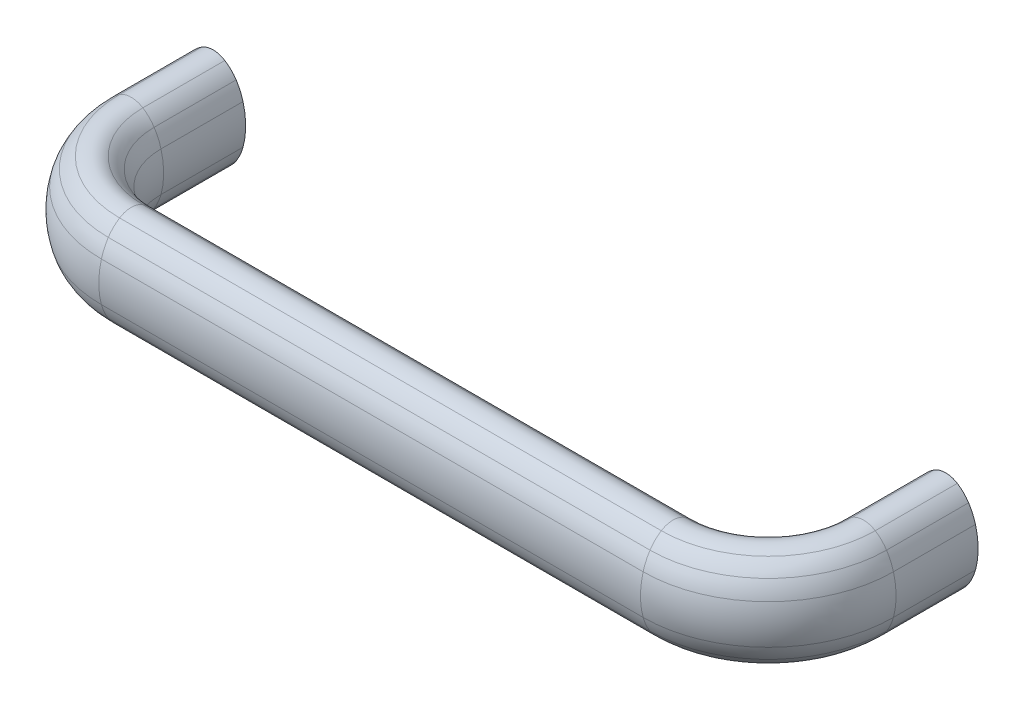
ISO-10303-21;
HEADER;
FILE_DESCRIPTION(('STEP AP214'),'2;1');
FILE_NAME('part.step','',(''),(''),'','','');
FILE_SCHEMA(('AUTOMOTIVE_DESIGN { 1 0 10303 214 1 1 1 1 }'));
ENDSEC;
DATA;
#1=APPLICATION_CONTEXT('core data for automotive mechanical design processes');
#2=APPLICATION_PROTOCOL_DEFINITION('international standard','automotive_design',2000,#1);
#3=PRODUCT_CONTEXT('',#1,'mechanical');
#4=PRODUCT('Part','Part','',(#3));
#5=PRODUCT_RELATED_PRODUCT_CATEGORY('part','',(#4));
#6=PRODUCT_DEFINITION_FORMATION('','',#4);
#7=PRODUCT_DEFINITION_CONTEXT('part definition',#1,'design');
#8=PRODUCT_DEFINITION('design','',#6,#7);
#9=PRODUCT_DEFINITION_SHAPE('','',#8);
#10=(LENGTH_UNIT() NAMED_UNIT(*) SI_UNIT(.MILLI.,.METRE.));
#11=(NAMED_UNIT(*) PLANE_ANGLE_UNIT() SI_UNIT($,.RADIAN.));
#12=(NAMED_UNIT(*) SI_UNIT($,.STERADIAN.) SOLID_ANGLE_UNIT());
#13=UNCERTAINTY_MEASURE_WITH_UNIT(LENGTH_MEASURE(1.E-05),#10,'distance_accuracy_value','');
#14=(GEOMETRIC_REPRESENTATION_CONTEXT(3) GLOBAL_UNCERTAINTY_ASSIGNED_CONTEXT((#13)) GLOBAL_UNIT_ASSIGNED_CONTEXT((#10,
#11,#12)) REPRESENTATION_CONTEXT('',''));
#15=CARTESIAN_POINT('',(0.,0.,0.));
#16=DIRECTION('',(0.,0.,1.));
#17=DIRECTION('',(1.,0.,0.));
#18=AXIS2_PLACEMENT_3D('',#15,#16,#17);
#19=CARTESIAN_POINT('',(193.10831860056,-5.5628443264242,0.));
#20=DIRECTION('',(0.,0.,-1.));
#21=DIRECTION('',(0.,-1.,0.));
#22=AXIS2_PLACEMENT_3D('',#19,#20,#21);
#23=PLANE('',#22);
#24=CARTESIAN_POINT('',(191.999387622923,-7.31331876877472,0.));
#25=DIRECTION('',(0.,0.,-1.));
#26=DIRECTION('',(0.,-1.,0.));
#27=AXIS2_PLACEMENT_3D('',#24,#25,#26);
#28=CIRCLE('',#27,5.68668538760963);
#29=CARTESIAN_POINT('',(195.042642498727,-12.1171703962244,0.));
#30=VERTEX_POINT('',#29);
#31=CARTESIAN_POINT('',(188.95613274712,-12.1171703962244,0.));
#32=VERTEX_POINT('',#31);
#33=EDGE_CURVE('E540',#30,#32,#28,.T.);
#34=ORIENTED_EDGE('',*,*,#33,.T.);
#35=CARTESIAN_POINT('',(194.217249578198,-3.81236988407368,0.));
#36=DIRECTION('',(0.,0.,-1.));
#37=DIRECTION('',(0.,-1.,0.));
#38=AXIS2_PLACEMENT_3D('',#35,#36,#37);
#39=CIRCLE('',#38,9.83102547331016);
#40=CARTESIAN_POINT('',(185.988979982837,-9.19239231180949,0.));
#41=VERTEX_POINT('',#40);
#42=EDGE_CURVE('E18',#32,#41,#39,.T.);
#43=ORIENTED_EDGE('',*,*,#42,.T.);
#44=CARTESIAN_POINT('',(197.739270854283,-1.50950981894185,0.));
#45=DIRECTION('',(0.,0.,-1.));
#46=DIRECTION('',(0.,-1.,0.));
#47=AXIS2_PLACEMENT_3D('',#44,#45,#46);
#48=CIRCLE('',#47,14.0390889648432);
#49=CARTESIAN_POINT('',(184.188367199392,-5.17952740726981,0.));
#50=VERTEX_POINT('',#49);
#51=EDGE_CURVE('E38',#41,#50,#48,.T.);
#52=ORIENTED_EDGE('',*,*,#51,.T.);
#53=CARTESIAN_POINT('',(203.312858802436,-4.15638432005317E-06,0.));
#54=DIRECTION('',(0.,0.,-1.));
#55=DIRECTION('',(0.,-1.,0.));
#56=AXIS2_PLACEMENT_3D('',#53,#54,#55);
#57=CIRCLE('',#56,19.8134711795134);
#58=CARTESIAN_POINT('',(184.188367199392,5.17951909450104,0.));
#59=VERTEX_POINT('',#58);
#60=EDGE_CURVE('E623',#50,#59,#57,.T.);
#61=ORIENTED_EDGE('',*,*,#60,.T.);
#62=CARTESIAN_POINT('',(197.739270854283,1.50950150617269,0.));
#63=DIRECTION('',(0.,0.,-1.));
#64=DIRECTION('',(0.,-1.,0.));
#65=AXIS2_PLACEMENT_3D('',#62,#63,#64);
#66=CIRCLE('',#65,14.0390889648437);
#67=CARTESIAN_POINT('',(185.988979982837,9.19238399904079,0.));
#68=VERTEX_POINT('',#67);
#69=EDGE_CURVE('E620',#59,#68,#66,.T.);
#70=ORIENTED_EDGE('',*,*,#69,.T.);
#71=CARTESIAN_POINT('',(194.217249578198,3.81236157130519,0.));
#72=DIRECTION('',(0.,0.,-1.));
#73=DIRECTION('',(0.,-1.,0.));
#74=AXIS2_PLACEMENT_3D('',#71,#72,#73);
#75=CIRCLE('',#74,9.83102547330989);
#76=CARTESIAN_POINT('',(188.95613274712,12.1171620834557,0.));
#77=VERTEX_POINT('',#76);
#78=EDGE_CURVE('E617',#68,#77,#75,.T.);
#79=ORIENTED_EDGE('',*,*,#78,.T.);
#80=CARTESIAN_POINT('',(191.999387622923,7.31331045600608,0.));
#81=DIRECTION('',(0.,0.,1.));
#82=DIRECTION('',(0.,1.,0.));
#83=AXIS2_PLACEMENT_3D('',#80,#81,#82);
#84=CIRCLE('',#83,5.68668538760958);
#85=CARTESIAN_POINT('',(195.042642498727,12.1171620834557,0.));
#86=VERTEX_POINT('',#85);
#87=EDGE_CURVE('E615',#86,#77,#84,.T.);
#88=ORIENTED_EDGE('',*,*,#87,.F.);
#89=CARTESIAN_POINT('',(189.781525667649,3.81236157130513,0.));
#90=DIRECTION('',(0.,0.,1.));
#91=DIRECTION('',(0.,1.,0.));
#92=AXIS2_PLACEMENT_3D('',#89,#90,#91);
#93=CIRCLE('',#92,9.83102547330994);
#94=CARTESIAN_POINT('',(198.009795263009,9.19238399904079,0.));
#95=VERTEX_POINT('',#94);
#96=EDGE_CURVE('E613',#95,#86,#93,.T.);
#97=ORIENTED_EDGE('',*,*,#96,.F.);
#98=CARTESIAN_POINT('',(186.259504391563,1.50950150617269,0.));
#99=DIRECTION('',(0.,0.,1.));
#100=DIRECTION('',(0.,1.,0.));
#101=AXIS2_PLACEMENT_3D('',#98,#99,#100);
#102=CIRCLE('',#101,14.0390889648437);
#103=CARTESIAN_POINT('',(199.810408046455,5.17951909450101,0.));
#104=VERTEX_POINT('',#103);
#105=EDGE_CURVE('E611',#104,#95,#102,.T.);
#106=ORIENTED_EDGE('',*,*,#105,.F.);
#107=CARTESIAN_POINT('',(180.68591644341,-4.1563845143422E-06,0.));
#108=DIRECTION('',(0.,0.,1.));
#109=DIRECTION('',(0.,1.,0.));
#110=AXIS2_PLACEMENT_3D('',#107,#108,#109);
#111=CIRCLE('',#110,19.8134711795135);
#112=CARTESIAN_POINT('',(199.810408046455,-5.17952740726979,0.));
#113=VERTEX_POINT('',#112);
#114=EDGE_CURVE('E609',#113,#104,#111,.T.);
#115=ORIENTED_EDGE('',*,*,#114,.F.);
#116=CARTESIAN_POINT('',(186.259504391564,-1.50950981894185,0.));
#117=DIRECTION('',(0.,0.,1.));
#118=DIRECTION('',(0.,1.,0.));
#119=AXIS2_PLACEMENT_3D('',#116,#117,#118);
#120=CIRCLE('',#119,14.0390889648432);
#121=CARTESIAN_POINT('',(198.009795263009,-9.19239231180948,0.));
#122=VERTEX_POINT('',#121);
#123=EDGE_CURVE('E607',#122,#113,#120,.T.);
#124=ORIENTED_EDGE('',*,*,#123,.F.);
#125=CARTESIAN_POINT('',(189.781525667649,-3.81236988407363,0.));
#126=DIRECTION('',(0.,0.,1.));
#127=DIRECTION('',(0.,1.,0.));
#128=AXIS2_PLACEMENT_3D('',#125,#126,#127);
#129=CIRCLE('',#128,9.83102547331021);
#130=EDGE_CURVE('E605',#30,#122,#129,.T.);
#131=ORIENTED_EDGE('',*,*,#130,.F.);
#132=EDGE_LOOP('',(#34,#43,#52,#61,#70,#79,#88,#97,#106,#115,#124,#131));
#133=FACE_BOUND('',#132,.T.);
#134=CARTESIAN_POINT('',(192.,0.,0.));
#135=DIRECTION('',(0.,0.,1.));
#136=DIRECTION('',(0.,1.,0.));
#137=AXIS2_PLACEMENT_3D('',#134,#135,#136);
#138=CIRCLE('',#137,4.52350000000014);
#139=CARTESIAN_POINT('',(192.,4.52350000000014,0.));
#140=VERTEX_POINT('',#139);
#141=EDGE_CURVE('E1387',#140,#140,#138,.T.);
#142=ORIENTED_EDGE('',*,*,#141,.T.);
#143=EDGE_LOOP('',(#142));
#144=FACE_BOUND('',#143,.T.);
#145=ADVANCED_FACE('F14',(#133,#144),#23,.T.);
#146=CARTESIAN_POINT('',(-1.10831860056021,-5.5628443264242,0.));
#147=DIRECTION('',(0.,0.,1.));
#148=DIRECTION('',(0.,-1.,0.));
#149=AXIS2_PLACEMENT_3D('',#146,#147,#148);
#150=PLANE('',#149);
#151=CARTESIAN_POINT('',(0.000612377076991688,-7.31331876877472,0.));
#152=DIRECTION('',(0.,0.,1.));
#153=DIRECTION('',(0.,-1.,0.));
#154=AXIS2_PLACEMENT_3D('',#151,#152,#153);
#155=CIRCLE('',#154,5.68668538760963);
#156=CARTESIAN_POINT('',(-3.04264249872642,-12.1171703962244,0.));
#157=VERTEX_POINT('',#156);
#158=CARTESIAN_POINT('',(3.04386725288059,-12.1171703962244,0.));
#159=VERTEX_POINT('',#158);
#160=EDGE_CURVE('E264',#157,#159,#155,.T.);
#161=ORIENTED_EDGE('',*,*,#160,.F.);
#162=CARTESIAN_POINT('',(2.21847433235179,-3.81236988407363,0.));
#163=DIRECTION('',(0.,0.,-1.));
#164=DIRECTION('',(0.,1.,0.));
#165=AXIS2_PLACEMENT_3D('',#162,#163,#164);
#166=CIRCLE('',#165,9.83102547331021);
#167=CARTESIAN_POINT('',(-6.00979526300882,-9.19239231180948,0.));
#168=VERTEX_POINT('',#167);
#169=EDGE_CURVE('E305',#157,#168,#166,.T.);
#170=ORIENTED_EDGE('',*,*,#169,.T.);
#171=CARTESIAN_POINT('',(5.74049560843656,-1.50950981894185,0.));
#172=DIRECTION('',(0.,0.,-1.));
#173=DIRECTION('',(0.,1.,0.));
#174=AXIS2_PLACEMENT_3D('',#171,#172,#173);
#175=CIRCLE('',#174,14.0390889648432);
#176=CARTESIAN_POINT('',(-7.81040804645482,-5.17952740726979,0.));
#177=VERTEX_POINT('',#176);
#178=EDGE_CURVE('E302',#168,#177,#175,.T.);
#179=ORIENTED_EDGE('',*,*,#178,.T.);
#180=CARTESIAN_POINT('',(11.3140835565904,-4.1563845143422E-06,0.));
#181=DIRECTION('',(0.,0.,-1.));
#182=DIRECTION('',(0.,1.,0.));
#183=AXIS2_PLACEMENT_3D('',#180,#181,#182);
#184=CIRCLE('',#183,19.8134711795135);
#185=CARTESIAN_POINT('',(-7.81040804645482,5.17951909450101,0.));
#186=VERTEX_POINT('',#185);
#187=EDGE_CURVE('E299',#177,#186,#184,.T.);
#188=ORIENTED_EDGE('',*,*,#187,.T.);
#189=CARTESIAN_POINT('',(5.74049560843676,1.50950150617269,0.));
#190=DIRECTION('',(0.,0.,-1.));
#191=DIRECTION('',(0.,1.,0.));
#192=AXIS2_PLACEMENT_3D('',#189,#190,#191);
#193=CIRCLE('',#192,14.0390889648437);
#194=CARTESIAN_POINT('',(-6.00979526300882,9.19238399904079,0.));
#195=VERTEX_POINT('',#194);
#196=EDGE_CURVE('E296',#186,#195,#193,.T.);
#197=ORIENTED_EDGE('',*,*,#196,.T.);
#198=CARTESIAN_POINT('',(2.21847433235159,3.81236157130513,0.));
#199=DIRECTION('',(0.,0.,-1.));
#200=DIRECTION('',(0.,1.,0.));
#201=AXIS2_PLACEMENT_3D('',#198,#199,#200);
#202=CIRCLE('',#201,9.83102547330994);
#203=CARTESIAN_POINT('',(-3.04264249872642,12.1171620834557,0.));
#204=VERTEX_POINT('',#203);
#205=EDGE_CURVE('E293',#195,#204,#202,.T.);
#206=ORIENTED_EDGE('',*,*,#205,.T.);
#207=CARTESIAN_POINT('',(0.000612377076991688,7.31331045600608,0.));
#208=DIRECTION('',(0.,0.,1.));
#209=DIRECTION('',(0.,-1.,0.));
#210=AXIS2_PLACEMENT_3D('',#207,#208,#209);
#211=CIRCLE('',#210,5.68668538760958);
#212=CARTESIAN_POINT('',(3.04386725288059,12.1171620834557,0.));
#213=VERTEX_POINT('',#212);
#214=EDGE_CURVE('E291',#213,#204,#211,.T.);
#215=ORIENTED_EDGE('',*,*,#214,.F.);
#216=CARTESIAN_POINT('',(-2.21724957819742,3.81236157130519,0.));
#217=DIRECTION('',(0.,0.,1.));
#218=DIRECTION('',(0.,-1.,0.));
#219=AXIS2_PLACEMENT_3D('',#216,#217,#218);
#220=CIRCLE('',#219,9.83102547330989);
#221=CARTESIAN_POINT('',(6.01102001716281,9.19238399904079,0.));
#222=VERTEX_POINT('',#221);
#223=EDGE_CURVE('E288',#222,#213,#220,.T.);
#224=ORIENTED_EDGE('',*,*,#223,.F.);
#225=CARTESIAN_POINT('',(-5.73927085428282,1.50950150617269,0.));
#226=DIRECTION('',(0.,0.,1.));
#227=DIRECTION('',(0.,-1.,0.));
#228=AXIS2_PLACEMENT_3D('',#225,#226,#227);
#229=CIRCLE('',#228,14.0390889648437);
#230=CARTESIAN_POINT('',(7.81163280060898,5.17951909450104,0.));
#231=VERTEX_POINT('',#230);
#232=EDGE_CURVE('E285',#231,#222,#229,.T.);
#233=ORIENTED_EDGE('',*,*,#232,.F.);
#234=CARTESIAN_POINT('',(-11.3128588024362,-4.15638432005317E-06,0.));
#235=DIRECTION('',(0.,0.,1.));
#236=DIRECTION('',(0.,-1.,0.));
#237=AXIS2_PLACEMENT_3D('',#234,#235,#236);
#238=CIRCLE('',#237,19.8134711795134);
#239=CARTESIAN_POINT('',(7.81163280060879,-5.17952740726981,0.));
#240=VERTEX_POINT('',#239);
#241=EDGE_CURVE('E279',#240,#231,#238,.T.);
#242=ORIENTED_EDGE('',*,*,#241,.F.);
#243=CARTESIAN_POINT('',(-5.73927085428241,-1.50950981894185,0.));
#244=DIRECTION('',(0.,0.,1.));
#245=DIRECTION('',(0.,-1.,0.));
#246=AXIS2_PLACEMENT_3D('',#243,#244,#245);
#247=CIRCLE('',#246,14.0390889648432);
#248=CARTESIAN_POINT('',(6.01102001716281,-9.19239231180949,0.));
#249=VERTEX_POINT('',#248);
#250=EDGE_CURVE('E277',#249,#240,#247,.T.);
#251=ORIENTED_EDGE('',*,*,#250,.F.);
#252=CARTESIAN_POINT('',(-2.21724957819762,-3.81236988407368,0.));
#253=DIRECTION('',(0.,0.,1.));
#254=DIRECTION('',(0.,-1.,0.));
#255=AXIS2_PLACEMENT_3D('',#252,#253,#254);
#256=CIRCLE('',#255,9.83102547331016);
#257=EDGE_CURVE('E255',#159,#249,#256,.T.);
#258=ORIENTED_EDGE('',*,*,#257,.F.);
#259=EDGE_LOOP('',(#161,#170,#179,#188,#197,#206,#215,#224,#233,#242,#251,#258));
#260=FACE_BOUND('',#259,.T.);
#261=CARTESIAN_POINT('',(0.,0.,0.));
#262=DIRECTION('',(0.,0.,-1.));
#263=DIRECTION('',(0.,1.,0.));
#264=AXIS2_PLACEMENT_3D('',#261,#262,#263);
#265=CIRCLE('',#264,4.52350000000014);
#266=CARTESIAN_POINT('',(0.,4.52350000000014,0.));
#267=VERTEX_POINT('',#266);
#268=EDGE_CURVE('E271',#267,#267,#265,.T.);
#269=ORIENTED_EDGE('',*,*,#268,.F.);
#270=EDGE_LOOP('',(#269));
#271=FACE_BOUND('',#270,.T.);
#272=ADVANCED_FACE('F273',(#260,#271),#150,.F.);
#273=CARTESIAN_POINT('',(194.217249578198,-3.81236988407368,21.5));
#274=DIRECTION('',(0.,0.,-1.));
#275=DIRECTION('',(0.,1.,0.));
#276=AXIS2_PLACEMENT_3D('',#273,#274,#275);
#277=CYLINDRICAL_SURFACE('',#276,9.83102547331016);
#278=CARTESIAN_POINT('',(194.217249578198,-3.81236988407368,21.5));
#279=DIRECTION('',(0.,0.,-1.));
#280=DIRECTION('',(0.,-1.,0.));
#281=AXIS2_PLACEMENT_3D('',#278,#279,#280);
#282=CIRCLE('',#281,9.83102547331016);
#283=CARTESIAN_POINT('',(188.95613274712,-12.1171703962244,21.5));
#284=VERTEX_POINT('',#283);
#285=CARTESIAN_POINT('',(185.988979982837,-9.19239231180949,21.5));
#286=VERTEX_POINT('',#285);
#287=EDGE_CURVE('E507',#284,#286,#282,.T.);
#288=ORIENTED_EDGE('',*,*,#287,.T.);
#289=DIRECTION('',(0.,0.,-1.));
#290=VECTOR('',#289,1.);
#291=CARTESIAN_POINT('',(185.988979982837,-9.19239231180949,21.5));
#292=LINE('',#291,#290);
#293=EDGE_CURVE('E23',#286,#41,#292,.T.);
#294=ORIENTED_EDGE('',*,*,#293,.T.);
#295=ORIENTED_EDGE('',*,*,#42,.F.);
#296=DIRECTION('',(0.,0.,-1.));
#297=VECTOR('',#296,1.);
#298=CARTESIAN_POINT('',(188.95613274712,-12.1171703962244,21.5));
#299=LINE('',#298,#297);
#300=EDGE_CURVE('E9',#284,#32,#299,.T.);
#301=ORIENTED_EDGE('',*,*,#300,.F.);
#302=EDGE_LOOP('',(#288,#294,#295,#301));
#303=FACE_BOUND('',#302,.T.);
#304=ADVANCED_FACE('F16',(#303),#277,.T.);
#305=CARTESIAN_POINT('',(197.739270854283,-1.50950981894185,21.5));
#306=DIRECTION('',(0.,0.,-1.));
#307=DIRECTION('',(0.,1.,0.));
#308=AXIS2_PLACEMENT_3D('',#305,#306,#307);
#309=CYLINDRICAL_SURFACE('',#308,14.0390889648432);
#310=CARTESIAN_POINT('',(197.739270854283,-1.50950981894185,21.5));
#311=DIRECTION('',(0.,0.,-1.));
#312=DIRECTION('',(0.,-1.,0.));
#313=AXIS2_PLACEMENT_3D('',#310,#311,#312);
#314=CIRCLE('',#313,14.0390889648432);
#315=CARTESIAN_POINT('',(184.188367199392,-5.17952740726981,21.5));
#316=VERTEX_POINT('',#315);
#317=EDGE_CURVE('E569',#286,#316,#314,.T.);
#318=ORIENTED_EDGE('',*,*,#317,.T.);
#319=DIRECTION('',(0.,0.,-1.));
#320=VECTOR('',#319,1.);
#321=CARTESIAN_POINT('',(184.188367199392,-5.17952740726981,21.5));
#322=LINE('',#321,#320);
#323=EDGE_CURVE('E601',#316,#50,#322,.T.);
#324=ORIENTED_EDGE('',*,*,#323,.T.);
#325=ORIENTED_EDGE('',*,*,#51,.F.);
#326=ORIENTED_EDGE('',*,*,#293,.F.);
#327=EDGE_LOOP('',(#318,#324,#325,#326));
#328=FACE_BOUND('',#327,.T.);
#329=ADVANCED_FACE('F630',(#328),#309,.T.);
#330=CARTESIAN_POINT('',(203.312858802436,-4.15638432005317E-06,21.5));
#331=DIRECTION('',(0.,0.,-1.));
#332=DIRECTION('',(0.,1.,0.));
#333=AXIS2_PLACEMENT_3D('',#330,#331,#332);
#334=CYLINDRICAL_SURFACE('',#333,19.8134711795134);
#335=CARTESIAN_POINT('',(203.312858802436,-4.15638432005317E-06,21.5));
#336=DIRECTION('',(0.,0.,-1.));
#337=DIRECTION('',(0.,-1.,0.));
#338=AXIS2_PLACEMENT_3D('',#335,#336,#337);
#339=CIRCLE('',#338,19.8134711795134);
#340=CARTESIAN_POINT('',(184.188367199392,5.17951909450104,21.5));
#341=VERTEX_POINT('',#340);
#342=EDGE_CURVE('E566',#316,#341,#339,.T.);
#343=ORIENTED_EDGE('',*,*,#342,.T.);
#344=DIRECTION('',(0.,0.,-1.));
#345=VECTOR('',#344,1.);
#346=CARTESIAN_POINT('',(184.188367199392,5.17951909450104,21.5));
#347=LINE('',#346,#345);
#348=EDGE_CURVE('E598',#341,#59,#347,.T.);
#349=ORIENTED_EDGE('',*,*,#348,.T.);
#350=ORIENTED_EDGE('',*,*,#60,.F.);
#351=ORIENTED_EDGE('',*,*,#323,.F.);
#352=EDGE_LOOP('',(#343,#349,#350,#351));
#353=FACE_BOUND('',#352,.T.);
#354=ADVANCED_FACE('F685',(#353),#334,.T.);
#355=CARTESIAN_POINT('',(197.739270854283,1.50950150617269,21.5));
#356=DIRECTION('',(0.,0.,-1.));
#357=DIRECTION('',(0.,1.,0.));
#358=AXIS2_PLACEMENT_3D('',#355,#356,#357);
#359=CYLINDRICAL_SURFACE('',#358,14.0390889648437);
#360=CARTESIAN_POINT('',(197.739270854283,1.50950150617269,21.5));
#361=DIRECTION('',(0.,0.,-1.));
#362=DIRECTION('',(0.,-1.,0.));
#363=AXIS2_PLACEMENT_3D('',#360,#361,#362);
#364=CIRCLE('',#363,14.0390889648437);
#365=CARTESIAN_POINT('',(185.988979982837,9.19238399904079,21.5));
#366=VERTEX_POINT('',#365);
#367=EDGE_CURVE('E563',#341,#366,#364,.T.);
#368=ORIENTED_EDGE('',*,*,#367,.T.);
#369=DIRECTION('',(0.,0.,-1.));
#370=VECTOR('',#369,1.);
#371=CARTESIAN_POINT('',(185.988979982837,9.19238399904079,21.5));
#372=LINE('',#371,#370);
#373=EDGE_CURVE('E595',#366,#68,#372,.T.);
#374=ORIENTED_EDGE('',*,*,#373,.T.);
#375=ORIENTED_EDGE('',*,*,#69,.F.);
#376=ORIENTED_EDGE('',*,*,#348,.F.);
#377=EDGE_LOOP('',(#368,#374,#375,#376));
#378=FACE_BOUND('',#377,.T.);
#379=ADVANCED_FACE('F684',(#378),#359,.T.);
#380=CARTESIAN_POINT('',(194.217249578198,3.81236157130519,21.5));
#381=DIRECTION('',(0.,0.,-1.));
#382=DIRECTION('',(0.,1.,0.));
#383=AXIS2_PLACEMENT_3D('',#380,#381,#382);
#384=CYLINDRICAL_SURFACE('',#383,9.83102547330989);
#385=CARTESIAN_POINT('',(194.217249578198,3.81236157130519,21.5));
#386=DIRECTION('',(0.,0.,-1.));
#387=DIRECTION('',(0.,-1.,0.));
#388=AXIS2_PLACEMENT_3D('',#385,#386,#387);
#389=CIRCLE('',#388,9.83102547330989);
#390=CARTESIAN_POINT('',(188.95613274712,12.1171620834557,21.5));
#391=VERTEX_POINT('',#390);
#392=EDGE_CURVE('E560',#366,#391,#389,.T.);
#393=ORIENTED_EDGE('',*,*,#392,.T.);
#394=DIRECTION('',(0.,0.,-1.));
#395=VECTOR('',#394,1.);
#396=CARTESIAN_POINT('',(188.95613274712,12.1171620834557,21.5));
#397=LINE('',#396,#395);
#398=EDGE_CURVE('E592',#391,#77,#397,.T.);
#399=ORIENTED_EDGE('',*,*,#398,.T.);
#400=ORIENTED_EDGE('',*,*,#78,.F.);
#401=ORIENTED_EDGE('',*,*,#373,.F.);
#402=EDGE_LOOP('',(#393,#399,#400,#401));
#403=FACE_BOUND('',#402,.T.);
#404=ADVANCED_FACE('F690',(#403),#384,.T.);
#405=CARTESIAN_POINT('',(191.999387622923,7.31331045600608,21.5));
#406=DIRECTION('',(0.,0.,-1.));
#407=DIRECTION('',(0.,1.,0.));
#408=AXIS2_PLACEMENT_3D('',#405,#406,#407);
#409=CYLINDRICAL_SURFACE('',#408,5.68668538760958);
#410=CARTESIAN_POINT('',(191.999387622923,7.31331045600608,21.5));
#411=DIRECTION('',(0.,0.,1.));
#412=DIRECTION('',(0.,1.,0.));
#413=AXIS2_PLACEMENT_3D('',#410,#411,#412);
#414=CIRCLE('',#413,5.68668538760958);
#415=CARTESIAN_POINT('',(195.042642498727,12.1171620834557,21.5));
#416=VERTEX_POINT('',#415);
#417=EDGE_CURVE('E558',#416,#391,#414,.T.);
#418=ORIENTED_EDGE('',*,*,#417,.F.);
#419=DIRECTION('',(0.,0.,-1.));
#420=VECTOR('',#419,1.);
#421=CARTESIAN_POINT('',(195.042642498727,12.1171620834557,21.5));
#422=LINE('',#421,#420);
#423=EDGE_CURVE('E589',#416,#86,#422,.T.);
#424=ORIENTED_EDGE('',*,*,#423,.T.);
#425=ORIENTED_EDGE('',*,*,#87,.T.);
#426=ORIENTED_EDGE('',*,*,#398,.F.);
#427=EDGE_LOOP('',(#418,#424,#425,#426));
#428=FACE_BOUND('',#427,.T.);
#429=ADVANCED_FACE('F693',(#428),#409,.T.);
#430=CARTESIAN_POINT('',(189.781525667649,3.81236157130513,21.5));
#431=DIRECTION('',(0.,0.,-1.));
#432=DIRECTION('',(0.,1.,0.));
#433=AXIS2_PLACEMENT_3D('',#430,#431,#432);
#434=CYLINDRICAL_SURFACE('',#433,9.83102547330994);
#435=CARTESIAN_POINT('',(189.781525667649,3.81236157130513,21.5));
#436=DIRECTION('',(0.,0.,1.));
#437=DIRECTION('',(0.,1.,0.));
#438=AXIS2_PLACEMENT_3D('',#435,#436,#437);
#439=CIRCLE('',#438,9.83102547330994);
#440=CARTESIAN_POINT('',(198.009795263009,9.19238399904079,21.5));
#441=VERTEX_POINT('',#440);
#442=EDGE_CURVE('E555',#441,#416,#439,.T.);
#443=ORIENTED_EDGE('',*,*,#442,.F.);
#444=DIRECTION('',(0.,0.,-1.));
#445=VECTOR('',#444,1.);
#446=CARTESIAN_POINT('',(198.009795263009,9.19238399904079,21.5));
#447=LINE('',#446,#445);
#448=EDGE_CURVE('E586',#441,#95,#447,.T.);
#449=ORIENTED_EDGE('',*,*,#448,.T.);
#450=ORIENTED_EDGE('',*,*,#96,.T.);
#451=ORIENTED_EDGE('',*,*,#423,.F.);
#452=EDGE_LOOP('',(#443,#449,#450,#451));
#453=FACE_BOUND('',#452,.T.);
#454=ADVANCED_FACE('F696',(#453),#434,.T.);
#455=CARTESIAN_POINT('',(186.259504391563,1.50950150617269,21.5));
#456=DIRECTION('',(0.,0.,-1.));
#457=DIRECTION('',(0.,1.,0.));
#458=AXIS2_PLACEMENT_3D('',#455,#456,#457);
#459=CYLINDRICAL_SURFACE('',#458,14.0390889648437);
#460=CARTESIAN_POINT('',(186.259504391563,1.50950150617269,21.5));
#461=DIRECTION('',(0.,0.,1.));
#462=DIRECTION('',(0.,1.,0.));
#463=AXIS2_PLACEMENT_3D('',#460,#461,#462);
#464=CIRCLE('',#463,14.0390889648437);
#465=CARTESIAN_POINT('',(199.810408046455,5.17951909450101,21.5));
#466=VERTEX_POINT('',#465);
#467=EDGE_CURVE('E552',#466,#441,#464,.T.);
#468=ORIENTED_EDGE('',*,*,#467,.F.);
#469=DIRECTION('',(0.,0.,-1.));
#470=VECTOR('',#469,1.);
#471=CARTESIAN_POINT('',(199.810408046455,5.17951909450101,21.5));
#472=LINE('',#471,#470);
#473=EDGE_CURVE('E583',#466,#104,#472,.T.);
#474=ORIENTED_EDGE('',*,*,#473,.T.);
#475=ORIENTED_EDGE('',*,*,#105,.T.);
#476=ORIENTED_EDGE('',*,*,#448,.F.);
#477=EDGE_LOOP('',(#468,#474,#475,#476));
#478=FACE_BOUND('',#477,.T.);
#479=ADVANCED_FACE('F702',(#478),#459,.T.);
#480=CARTESIAN_POINT('',(180.68591644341,-4.1563845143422E-06,21.5));
#481=DIRECTION('',(0.,0.,-1.));
#482=DIRECTION('',(0.,1.,0.));
#483=AXIS2_PLACEMENT_3D('',#480,#481,#482);
#484=CYLINDRICAL_SURFACE('',#483,19.8134711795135);
#485=CARTESIAN_POINT('',(180.68591644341,-4.1563845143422E-06,21.5));
#486=DIRECTION('',(0.,0.,1.));
#487=DIRECTION('',(0.,1.,0.));
#488=AXIS2_PLACEMENT_3D('',#485,#486,#487);
#489=CIRCLE('',#488,19.8134711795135);
#490=CARTESIAN_POINT('',(199.810408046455,-5.17952740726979,21.5));
#491=VERTEX_POINT('',#490);
#492=EDGE_CURVE('E549',#491,#466,#489,.T.);
#493=ORIENTED_EDGE('',*,*,#492,.F.);
#494=DIRECTION('',(0.,0.,-1.));
#495=VECTOR('',#494,1.);
#496=CARTESIAN_POINT('',(199.810408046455,-5.17952740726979,21.5));
#497=LINE('',#496,#495);
#498=EDGE_CURVE('E580',#491,#113,#497,.T.);
#499=ORIENTED_EDGE('',*,*,#498,.T.);
#500=ORIENTED_EDGE('',*,*,#114,.T.);
#501=ORIENTED_EDGE('',*,*,#473,.F.);
#502=EDGE_LOOP('',(#493,#499,#500,#501));
#503=FACE_BOUND('',#502,.T.);
#504=ADVANCED_FACE('F705',(#503),#484,.T.);
#505=CARTESIAN_POINT('',(186.259504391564,-1.50950981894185,21.5));
#506=DIRECTION('',(0.,0.,-1.));
#507=DIRECTION('',(0.,1.,0.));
#508=AXIS2_PLACEMENT_3D('',#505,#506,#507);
#509=CYLINDRICAL_SURFACE('',#508,14.0390889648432);
#510=CARTESIAN_POINT('',(186.259504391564,-1.50950981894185,21.5));
#511=DIRECTION('',(0.,0.,1.));
#512=DIRECTION('',(0.,1.,0.));
#513=AXIS2_PLACEMENT_3D('',#510,#511,#512);
#514=CIRCLE('',#513,14.0390889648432);
#515=CARTESIAN_POINT('',(198.009795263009,-9.19239231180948,21.5));
#516=VERTEX_POINT('',#515);
#517=EDGE_CURVE('E546',#516,#491,#514,.T.);
#518=ORIENTED_EDGE('',*,*,#517,.F.);
#519=DIRECTION('',(0.,0.,-1.));
#520=VECTOR('',#519,1.);
#521=CARTESIAN_POINT('',(198.009795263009,-9.19239231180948,21.5));
#522=LINE('',#521,#520);
#523=EDGE_CURVE('E577',#516,#122,#522,.T.);
#524=ORIENTED_EDGE('',*,*,#523,.T.);
#525=ORIENTED_EDGE('',*,*,#123,.T.);
#526=ORIENTED_EDGE('',*,*,#498,.F.);
#527=EDGE_LOOP('',(#518,#524,#525,#526));
#528=FACE_BOUND('',#527,.T.);
#529=ADVANCED_FACE('F708',(#528),#509,.T.);
#530=CARTESIAN_POINT('',(189.781525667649,-3.81236988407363,21.5));
#531=DIRECTION('',(0.,0.,-1.));
#532=DIRECTION('',(0.,1.,0.));
#533=AXIS2_PLACEMENT_3D('',#530,#531,#532);
#534=CYLINDRICAL_SURFACE('',#533,9.83102547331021);
#535=CARTESIAN_POINT('',(189.781525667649,-3.81236988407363,21.5));
#536=DIRECTION('',(0.,0.,1.));
#537=DIRECTION('',(0.,1.,0.));
#538=AXIS2_PLACEMENT_3D('',#535,#536,#537);
#539=CIRCLE('',#538,9.83102547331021);
#540=CARTESIAN_POINT('',(195.042642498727,-12.1171703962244,21.5));
#541=VERTEX_POINT('',#540);
#542=EDGE_CURVE('E543',#541,#516,#539,.T.);
#543=ORIENTED_EDGE('',*,*,#542,.F.);
#544=DIRECTION('',(0.,0.,-1.));
#545=VECTOR('',#544,1.);
#546=CARTESIAN_POINT('',(195.042642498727,-12.1171703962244,21.5));
#547=LINE('',#546,#545);
#548=EDGE_CURVE('E574',#541,#30,#547,.T.);
#549=ORIENTED_EDGE('',*,*,#548,.T.);
#550=ORIENTED_EDGE('',*,*,#130,.T.);
#551=ORIENTED_EDGE('',*,*,#523,.F.);
#552=EDGE_LOOP('',(#543,#549,#550,#551));
#553=FACE_BOUND('',#552,.T.);
#554=ADVANCED_FACE('F712',(#553),#534,.T.);
#555=CARTESIAN_POINT('',(191.999387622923,-7.31331876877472,21.5));
#556=DIRECTION('',(0.,0.,-1.));
#557=DIRECTION('',(0.,1.,0.));
#558=AXIS2_PLACEMENT_3D('',#555,#556,#557);
#559=CYLINDRICAL_SURFACE('',#558,5.68668538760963);
#560=CARTESIAN_POINT('',(191.999387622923,-7.31331876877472,21.5));
#561=DIRECTION('',(0.,0.,-1.));
#562=DIRECTION('',(0.,-1.,0.));
#563=AXIS2_PLACEMENT_3D('',#560,#561,#562);
#564=CIRCLE('',#563,5.68668538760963);
#565=EDGE_CURVE('E469',#541,#284,#564,.T.);
#566=ORIENTED_EDGE('',*,*,#565,.T.);
#567=ORIENTED_EDGE('',*,*,#300,.T.);
#568=ORIENTED_EDGE('',*,*,#33,.F.);
#569=ORIENTED_EDGE('',*,*,#548,.F.);
#570=EDGE_LOOP('',(#566,#567,#568,#569));
#571=FACE_BOUND('',#570,.T.);
#572=ADVANCED_FACE('F714',(#571),#559,.T.);
#573=CARTESIAN_POINT('',(167.,-3.81236988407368,21.5));
#574=DIRECTION('',(0.,1.,0.));
#575=DIRECTION('',(-1.,0.,0.));
#576=AXIS2_PLACEMENT_3D('',#573,#574,#575);
#577=TOROIDAL_SURFACE('',#576,27.2172495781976,9.83102547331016);
#578=CARTESIAN_POINT('',(167.,-3.81236988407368,48.7172495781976));
#579=DIRECTION('',(1.,0.,0.));
#580=DIRECTION('',(0.,-1.,0.));
#581=AXIS2_PLACEMENT_3D('',#578,#579,#580);
#582=CIRCLE('',#581,9.83102547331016);
#583=CARTESIAN_POINT('',(167.,-12.1171703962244,43.4561327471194));
#584=VERTEX_POINT('',#583);
#585=CARTESIAN_POINT('',(167.,-9.19239231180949,40.4889799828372));
#586=VERTEX_POINT('',#585);
#587=EDGE_CURVE('E436',#584,#586,#582,.T.);
#588=ORIENTED_EDGE('',*,*,#587,.T.);
#589=CARTESIAN_POINT('',(167.,-9.19239231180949,21.5));
#590=DIRECTION('',(0.,1.,0.));
#591=DIRECTION('',(-1.,0.,0.));
#592=AXIS2_PLACEMENT_3D('',#589,#590,#591);
#593=CIRCLE('',#592,18.9889799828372);
#594=EDGE_CURVE('E534',#586,#286,#593,.T.);
#595=ORIENTED_EDGE('',*,*,#594,.T.);
#596=ORIENTED_EDGE('',*,*,#287,.F.);
#597=CARTESIAN_POINT('',(167.,-12.1171703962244,21.5));
#598=DIRECTION('',(0.,1.,0.));
#599=DIRECTION('',(-1.,0.,0.));
#600=AXIS2_PLACEMENT_3D('',#597,#598,#599);
#601=CIRCLE('',#600,21.9561327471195);
#602=EDGE_CURVE('E537',#584,#284,#601,.T.);
#603=ORIENTED_EDGE('',*,*,#602,.F.);
#604=EDGE_LOOP('',(#588,#595,#596,#603));
#605=FACE_BOUND('',#604,.T.);
#606=ADVANCED_FACE('F718',(#605),#577,.T.);
#607=CARTESIAN_POINT('',(167.,-1.50950981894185,21.5));
#608=DIRECTION('',(0.,1.,0.));
#609=DIRECTION('',(-1.,0.,0.));
#610=AXIS2_PLACEMENT_3D('',#607,#608,#609);
#611=TOROIDAL_SURFACE('',#610,30.7392708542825,14.0390889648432);
#612=CARTESIAN_POINT('',(167.,-1.50950981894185,52.2392708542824));
#613=DIRECTION('',(1.,0.,0.));
#614=DIRECTION('',(0.,-1.,0.));
#615=AXIS2_PLACEMENT_3D('',#612,#613,#614);
#616=CIRCLE('',#615,14.0390889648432);
#617=CARTESIAN_POINT('',(167.,-5.17952740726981,38.6883671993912));
#618=VERTEX_POINT('',#617);
#619=EDGE_CURVE('E498',#586,#618,#616,.T.);
#620=ORIENTED_EDGE('',*,*,#619,.T.);
#621=CARTESIAN_POINT('',(167.,-5.17952740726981,21.5));
#622=DIRECTION('',(0.,1.,0.));
#623=DIRECTION('',(-1.,0.,0.));
#624=AXIS2_PLACEMENT_3D('',#621,#622,#623);
#625=CIRCLE('',#624,17.1883671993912);
#626=EDGE_CURVE('E531',#618,#316,#625,.T.);
#627=ORIENTED_EDGE('',*,*,#626,.T.);
#628=ORIENTED_EDGE('',*,*,#317,.F.);
#629=ORIENTED_EDGE('',*,*,#594,.F.);
#630=EDGE_LOOP('',(#620,#627,#628,#629));
#631=FACE_BOUND('',#630,.T.);
#632=ADVANCED_FACE('F637',(#631),#611,.T.);
#633=CARTESIAN_POINT('',(167.,-4.15638432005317E-06,21.5));
#634=DIRECTION('',(0.,1.,0.));
#635=DIRECTION('',(-1.,0.,0.));
#636=AXIS2_PLACEMENT_3D('',#633,#634,#635);
#637=TOROIDAL_SURFACE('',#636,36.3128588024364,19.8134711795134);
#638=CARTESIAN_POINT('',(167.,-4.15638432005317E-06,57.8128588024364));
#639=DIRECTION('',(1.,0.,0.));
#640=DIRECTION('',(0.,-1.,0.));
#641=AXIS2_PLACEMENT_3D('',#638,#639,#640);
#642=CIRCLE('',#641,19.8134711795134);
#643=CARTESIAN_POINT('',(167.,5.17951909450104,38.6883671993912));
#644=VERTEX_POINT('',#643);
#645=EDGE_CURVE('E495',#618,#644,#642,.T.);
#646=ORIENTED_EDGE('',*,*,#645,.T.);
#647=CARTESIAN_POINT('',(167.,5.17951909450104,21.5));
#648=DIRECTION('',(0.,1.,0.));
#649=DIRECTION('',(-1.,0.,0.));
#650=AXIS2_PLACEMENT_3D('',#647,#648,#649);
#651=CIRCLE('',#650,17.1883671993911);
#652=EDGE_CURVE('E528',#644,#341,#651,.T.);
#653=ORIENTED_EDGE('',*,*,#652,.T.);
#654=ORIENTED_EDGE('',*,*,#342,.F.);
#655=ORIENTED_EDGE('',*,*,#626,.F.);
#656=EDGE_LOOP('',(#646,#653,#654,#655));
#657=FACE_BOUND('',#656,.T.);
#658=ADVANCED_FACE('F634',(#657),#637,.T.);
#659=CARTESIAN_POINT('',(167.,1.50950150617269,21.5));
#660=DIRECTION('',(0.,1.,0.));
#661=DIRECTION('',(-1.,0.,0.));
#662=AXIS2_PLACEMENT_3D('',#659,#660,#661);
#663=TOROIDAL_SURFACE('',#662,30.7392708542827,14.0390889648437);
#664=CARTESIAN_POINT('',(167.,1.50950150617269,52.2392708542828));
#665=DIRECTION('',(1.,0.,0.));
#666=DIRECTION('',(0.,-1.,0.));
#667=AXIS2_PLACEMENT_3D('',#664,#665,#666);
#668=CIRCLE('',#667,14.0390889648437);
#669=CARTESIAN_POINT('',(167.,9.19238399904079,40.4889799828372));
#670=VERTEX_POINT('',#669);
#671=EDGE_CURVE('E492',#644,#670,#668,.T.);
#672=ORIENTED_EDGE('',*,*,#671,.T.);
#673=CARTESIAN_POINT('',(167.,9.19238399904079,21.5));
#674=DIRECTION('',(0.,1.,0.));
#675=DIRECTION('',(-1.,0.,0.));
#676=AXIS2_PLACEMENT_3D('',#673,#674,#675);
#677=CIRCLE('',#676,18.9889799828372);
#678=EDGE_CURVE('E525',#670,#366,#677,.T.);
#679=ORIENTED_EDGE('',*,*,#678,.T.);
#680=ORIENTED_EDGE('',*,*,#367,.F.);
#681=ORIENTED_EDGE('',*,*,#652,.F.);
#682=EDGE_LOOP('',(#672,#679,#680,#681));
#683=FACE_BOUND('',#682,.T.);
#684=ADVANCED_FACE('F682',(#683),#663,.T.);
#685=CARTESIAN_POINT('',(167.,3.81236157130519,21.5));
#686=DIRECTION('',(0.,1.,0.));
#687=DIRECTION('',(-1.,0.,0.));
#688=AXIS2_PLACEMENT_3D('',#685,#686,#687);
#689=TOROIDAL_SURFACE('',#688,27.2172495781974,9.83102547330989);
#690=CARTESIAN_POINT('',(167.,3.81236157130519,48.7172495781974));
#691=DIRECTION('',(1.,0.,0.));
#692=DIRECTION('',(0.,-1.,0.));
#693=AXIS2_PLACEMENT_3D('',#690,#691,#692);
#694=CIRCLE('',#693,9.83102547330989);
#695=CARTESIAN_POINT('',(167.,12.1171620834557,43.4561327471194));
#696=VERTEX_POINT('',#695);
#697=EDGE_CURVE('E489',#670,#696,#694,.T.);
#698=ORIENTED_EDGE('',*,*,#697,.T.);
#699=CARTESIAN_POINT('',(167.,12.1171620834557,21.5));
#700=DIRECTION('',(0.,1.,0.));
#701=DIRECTION('',(-1.,0.,0.));
#702=AXIS2_PLACEMENT_3D('',#699,#700,#701);
#703=CIRCLE('',#702,21.9561327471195);
#704=EDGE_CURVE('E522',#696,#391,#703,.T.);
#705=ORIENTED_EDGE('',*,*,#704,.T.);
#706=ORIENTED_EDGE('',*,*,#392,.F.);
#707=ORIENTED_EDGE('',*,*,#678,.F.);
#708=EDGE_LOOP('',(#698,#705,#706,#707));
#709=FACE_BOUND('',#708,.T.);
#710=ADVANCED_FACE('F678',(#709),#689,.T.);
#711=CARTESIAN_POINT('',(167.,7.31331045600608,21.5));
#712=DIRECTION('',(0.,1.,0.));
#713=DIRECTION('',(-1.,0.,0.));
#714=AXIS2_PLACEMENT_3D('',#711,#712,#713);
#715=TOROIDAL_SURFACE('',#714,24.999387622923,5.68668538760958);
#716=CARTESIAN_POINT('',(167.,7.31331045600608,46.499387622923));
#717=DIRECTION('',(-1.,0.,0.));
#718=DIRECTION('',(0.,1.,0.));
#719=AXIS2_PLACEMENT_3D('',#716,#717,#718);
#720=CIRCLE('',#719,5.68668538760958);
#721=CARTESIAN_POINT('',(167.,12.1171620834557,49.5426424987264));
#722=VERTEX_POINT('',#721);
#723=EDGE_CURVE('E487',#722,#696,#720,.T.);
#724=ORIENTED_EDGE('',*,*,#723,.F.);
#725=CARTESIAN_POINT('',(167.,12.1171620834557,21.5));
#726=DIRECTION('',(0.,1.,0.));
#727=DIRECTION('',(-1.,0.,0.));
#728=AXIS2_PLACEMENT_3D('',#725,#726,#727);
#729=CIRCLE('',#728,28.0426424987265);
#730=EDGE_CURVE('E519',#722,#416,#729,.T.);
#731=ORIENTED_EDGE('',*,*,#730,.T.);
#732=ORIENTED_EDGE('',*,*,#417,.T.);
#733=ORIENTED_EDGE('',*,*,#704,.F.);
#734=EDGE_LOOP('',(#724,#731,#732,#733));
#735=FACE_BOUND('',#734,.T.);
#736=ADVANCED_FACE('F1023',(#735),#715,.T.);
#737=CARTESIAN_POINT('',(167.,3.81236157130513,21.5));
#738=DIRECTION('',(0.,1.,0.));
#739=DIRECTION('',(-1.,0.,0.));
#740=AXIS2_PLACEMENT_3D('',#737,#738,#739);
#741=TOROIDAL_SURFACE('',#740,22.7815256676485,9.83102547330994);
#742=CARTESIAN_POINT('',(167.,3.81236157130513,44.2815256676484));
#743=DIRECTION('',(-1.,0.,0.));
#744=DIRECTION('',(0.,1.,0.));
#745=AXIS2_PLACEMENT_3D('',#742,#743,#744);
#746=CIRCLE('',#745,9.83102547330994);
#747=CARTESIAN_POINT('',(167.,9.19238399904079,52.5097952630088));
#748=VERTEX_POINT('',#747);
#749=EDGE_CURVE('E484',#748,#722,#746,.T.);
#750=ORIENTED_EDGE('',*,*,#749,.F.);
#751=CARTESIAN_POINT('',(167.,9.19238399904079,21.5));
#752=DIRECTION('',(0.,1.,0.));
#753=DIRECTION('',(-1.,0.,0.));
#754=AXIS2_PLACEMENT_3D('',#751,#752,#753);
#755=CIRCLE('',#754,31.0097952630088);
#756=EDGE_CURVE('E516',#748,#441,#755,.T.);
#757=ORIENTED_EDGE('',*,*,#756,.T.);
#758=ORIENTED_EDGE('',*,*,#442,.T.);
#759=ORIENTED_EDGE('',*,*,#730,.F.);
#760=EDGE_LOOP('',(#750,#757,#758,#759));
#761=FACE_BOUND('',#760,.T.);
#762=ADVANCED_FACE('F1032',(#761),#741,.T.);
#763=CARTESIAN_POINT('',(167.,1.50950150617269,21.5));
#764=DIRECTION('',(0.,1.,0.));
#765=DIRECTION('',(-1.,0.,0.));
#766=AXIS2_PLACEMENT_3D('',#763,#764,#765);
#767=TOROIDAL_SURFACE('',#766,19.2595043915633,14.0390889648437);
#768=CARTESIAN_POINT('',(167.,1.50950150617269,40.7595043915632));
#769=DIRECTION('',(-1.,0.,0.));
#770=DIRECTION('',(0.,1.,0.));
#771=AXIS2_PLACEMENT_3D('',#768,#769,#770);
#772=CIRCLE('',#771,14.0390889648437);
#773=CARTESIAN_POINT('',(167.,5.17951909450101,54.3104080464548));
#774=VERTEX_POINT('',#773);
#775=EDGE_CURVE('E481',#774,#748,#772,.T.);
#776=ORIENTED_EDGE('',*,*,#775,.F.);
#777=CARTESIAN_POINT('',(167.,5.17951909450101,21.5));
#778=DIRECTION('',(0.,1.,0.));
#779=DIRECTION('',(-1.,0.,0.));
#780=AXIS2_PLACEMENT_3D('',#777,#778,#779);
#781=CIRCLE('',#780,32.8104080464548);
#782=EDGE_CURVE('E513',#774,#466,#781,.T.);
#783=ORIENTED_EDGE('',*,*,#782,.T.);
#784=ORIENTED_EDGE('',*,*,#467,.T.);
#785=ORIENTED_EDGE('',*,*,#756,.F.);
#786=EDGE_LOOP('',(#776,#783,#784,#785));
#787=FACE_BOUND('',#786,.T.);
#788=ADVANCED_FACE('F1042',(#787),#767,.T.);
#789=CARTESIAN_POINT('',(167.,-4.1563845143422E-06,21.5));
#790=DIRECTION('',(0.,1.,0.));
#791=DIRECTION('',(-1.,0.,0.));
#792=AXIS2_PLACEMENT_3D('',#789,#790,#791);
#793=DEGENERATE_TOROIDAL_SURFACE('',#792,13.6859164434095,19.8134711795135,.T.);
#794=CARTESIAN_POINT('',(167.,-4.1563845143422E-06,35.1859164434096));
#795=DIRECTION('',(-1.,0.,0.));
#796=DIRECTION('',(0.,1.,0.));
#797=AXIS2_PLACEMENT_3D('',#794,#795,#796);
#798=CIRCLE('',#797,19.8134711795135);
#799=CARTESIAN_POINT('',(167.,-5.17952740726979,54.3104080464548));
#800=VERTEX_POINT('',#799);
#801=EDGE_CURVE('E478',#800,#774,#798,.T.);
#802=ORIENTED_EDGE('',*,*,#801,.F.);
#803=CARTESIAN_POINT('',(167.,-5.17952740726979,21.5));
#804=DIRECTION('',(0.,1.,0.));
#805=DIRECTION('',(-1.,0.,0.));
#806=AXIS2_PLACEMENT_3D('',#803,#804,#805);
#807=CIRCLE('',#806,32.8104080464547);
#808=EDGE_CURVE('E510',#800,#491,#807,.T.);
#809=ORIENTED_EDGE('',*,*,#808,.T.);
#810=ORIENTED_EDGE('',*,*,#492,.T.);
#811=ORIENTED_EDGE('',*,*,#782,.F.);
#812=EDGE_LOOP('',(#802,#809,#810,#811));
#813=FACE_BOUND('',#812,.T.);
#814=ADVANCED_FACE('F1052',(#813),#793,.T.);
#815=CARTESIAN_POINT('',(167.,-1.50950981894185,21.5));
#816=DIRECTION('',(0.,1.,0.));
#817=DIRECTION('',(-1.,0.,0.));
#818=AXIS2_PLACEMENT_3D('',#815,#816,#817);
#819=TOROIDAL_SURFACE('',#818,19.2595043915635,14.0390889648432);
#820=CARTESIAN_POINT('',(167.,-1.50950981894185,40.7595043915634));
#821=DIRECTION('',(-1.,0.,0.));
#822=DIRECTION('',(0.,1.,0.));
#823=AXIS2_PLACEMENT_3D('',#820,#821,#822);
#824=CIRCLE('',#823,14.0390889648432);
#825=CARTESIAN_POINT('',(167.,-9.19239231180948,52.5097952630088));
#826=VERTEX_POINT('',#825);
#827=EDGE_CURVE('E475',#826,#800,#824,.T.);
#828=ORIENTED_EDGE('',*,*,#827,.F.);
#829=CARTESIAN_POINT('',(167.,-9.19239231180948,21.5));
#830=DIRECTION('',(0.,1.,0.));
#831=DIRECTION('',(-1.,0.,0.));
#832=AXIS2_PLACEMENT_3D('',#829,#830,#831);
#833=CIRCLE('',#832,31.0097952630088);
#834=EDGE_CURVE('E506',#826,#516,#833,.T.);
#835=ORIENTED_EDGE('',*,*,#834,.T.);
#836=ORIENTED_EDGE('',*,*,#517,.T.);
#837=ORIENTED_EDGE('',*,*,#808,.F.);
#838=EDGE_LOOP('',(#828,#835,#836,#837));
#839=FACE_BOUND('',#838,.T.);
#840=ADVANCED_FACE('F1062',(#839),#819,.T.);
#841=CARTESIAN_POINT('',(167.,-3.81236988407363,21.5));
#842=DIRECTION('',(0.,1.,0.));
#843=DIRECTION('',(-1.,0.,0.));
#844=AXIS2_PLACEMENT_3D('',#841,#842,#843);
#845=TOROIDAL_SURFACE('',#844,22.7815256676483,9.83102547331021);
#846=CARTESIAN_POINT('',(167.,-3.81236988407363,44.2815256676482));
#847=DIRECTION('',(-1.,0.,0.));
#848=DIRECTION('',(0.,1.,0.));
#849=AXIS2_PLACEMENT_3D('',#846,#847,#848);
#850=CIRCLE('',#849,9.83102547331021);
#851=CARTESIAN_POINT('',(167.,-12.1171703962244,49.5426424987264));
#852=VERTEX_POINT('',#851);
#853=EDGE_CURVE('E472',#852,#826,#850,.T.);
#854=ORIENTED_EDGE('',*,*,#853,.F.);
#855=CARTESIAN_POINT('',(167.,-12.1171703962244,21.5));
#856=DIRECTION('',(0.,1.,0.));
#857=DIRECTION('',(-1.,0.,0.));
#858=AXIS2_PLACEMENT_3D('',#855,#856,#857);
#859=CIRCLE('',#858,28.0426424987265);
#860=EDGE_CURVE('E503',#852,#541,#859,.T.);
#861=ORIENTED_EDGE('',*,*,#860,.T.);
#862=ORIENTED_EDGE('',*,*,#542,.T.);
#863=ORIENTED_EDGE('',*,*,#834,.F.);
#864=EDGE_LOOP('',(#854,#861,#862,#863));
#865=FACE_BOUND('',#864,.T.);
#866=ADVANCED_FACE('F1072',(#865),#845,.T.);
#867=CARTESIAN_POINT('',(167.,-7.31331876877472,21.5));
#868=DIRECTION('',(0.,1.,0.));
#869=DIRECTION('',(-1.,0.,0.));
#870=AXIS2_PLACEMENT_3D('',#867,#868,#869);
#871=TOROIDAL_SURFACE('',#870,24.999387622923,5.68668538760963);
#872=CARTESIAN_POINT('',(167.,-7.31331876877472,46.499387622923));
#873=DIRECTION('',(1.,0.,0.));
#874=DIRECTION('',(0.,-1.,0.));
#875=AXIS2_PLACEMENT_3D('',#872,#873,#874);
#876=CIRCLE('',#875,5.68668538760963);
#877=EDGE_CURVE('E398',#852,#584,#876,.T.);
#878=ORIENTED_EDGE('',*,*,#877,.T.);
#879=ORIENTED_EDGE('',*,*,#602,.T.);
#880=ORIENTED_EDGE('',*,*,#565,.F.);
#881=ORIENTED_EDGE('',*,*,#860,.F.);
#882=EDGE_LOOP('',(#878,#879,#880,#881));
#883=FACE_BOUND('',#882,.T.);
#884=ADVANCED_FACE('F719',(#883),#871,.T.);
#885=CARTESIAN_POINT('',(25.,-3.81236988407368,48.7172495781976));
#886=DIRECTION('',(1.,0.,0.));
#887=DIRECTION('',(0.,1.,0.));
#888=AXIS2_PLACEMENT_3D('',#885,#886,#887);
#889=CYLINDRICAL_SURFACE('',#888,9.83102547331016);
#890=CARTESIAN_POINT('',(25.,-3.81236988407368,48.7172495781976));
#891=DIRECTION('',(1.,0.,0.));
#892=DIRECTION('',(0.,-1.,0.));
#893=AXIS2_PLACEMENT_3D('',#890,#891,#892);
#894=CIRCLE('',#893,9.83102547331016);
#895=CARTESIAN_POINT('',(25.,-12.1171703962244,43.4561327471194));
#896=VERTEX_POINT('',#895);
#897=CARTESIAN_POINT('',(25.,-9.19239231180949,40.4889799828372));
#898=VERTEX_POINT('',#897);
#899=EDGE_CURVE('E365',#896,#898,#894,.T.);
#900=ORIENTED_EDGE('',*,*,#899,.T.);
#901=DIRECTION('',(1.,0.,0.));
#902=VECTOR('',#901,1.);
#903=CARTESIAN_POINT('',(25.,-9.19239231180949,40.4889799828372));
#904=LINE('',#903,#902);
#905=EDGE_CURVE('E463',#898,#586,#904,.T.);
#906=ORIENTED_EDGE('',*,*,#905,.T.);
#907=ORIENTED_EDGE('',*,*,#587,.F.);
#908=DIRECTION('',(1.,0.,0.));
#909=VECTOR('',#908,1.);
#910=CARTESIAN_POINT('',(25.,-12.1171703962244,43.4561327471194));
#911=LINE('',#910,#909);
#912=EDGE_CURVE('E466',#896,#584,#911,.T.);
#913=ORIENTED_EDGE('',*,*,#912,.F.);
#914=EDGE_LOOP('',(#900,#906,#907,#913));
#915=FACE_BOUND('',#914,.T.);
#916=ADVANCED_FACE('F725',(#915),#889,.T.);
#917=CARTESIAN_POINT('',(25.,-1.50950981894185,52.2392708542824));
#918=DIRECTION('',(1.,0.,0.));
#919=DIRECTION('',(0.,1.,0.));
#920=AXIS2_PLACEMENT_3D('',#917,#918,#919);
#921=CYLINDRICAL_SURFACE('',#920,14.0390889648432);
#922=CARTESIAN_POINT('',(25.,-1.50950981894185,52.2392708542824));
#923=DIRECTION('',(1.,0.,0.));
#924=DIRECTION('',(0.,-1.,0.));
#925=AXIS2_PLACEMENT_3D('',#922,#923,#924);
#926=CIRCLE('',#925,14.0390889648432);
#927=CARTESIAN_POINT('',(25.,-5.17952740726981,38.6883671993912));
#928=VERTEX_POINT('',#927);
#929=EDGE_CURVE('E427',#898,#928,#926,.T.);
#930=ORIENTED_EDGE('',*,*,#929,.T.);
#931=DIRECTION('',(1.,0.,0.));
#932=VECTOR('',#931,1.);
#933=CARTESIAN_POINT('',(25.,-5.17952740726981,38.6883671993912));
#934=LINE('',#933,#932);
#935=EDGE_CURVE('E460',#928,#618,#934,.T.);
#936=ORIENTED_EDGE('',*,*,#935,.T.);
#937=ORIENTED_EDGE('',*,*,#619,.F.);
#938=ORIENTED_EDGE('',*,*,#905,.F.);
#939=EDGE_LOOP('',(#930,#936,#937,#938));
#940=FACE_BOUND('',#939,.T.);
#941=ADVANCED_FACE('F644',(#940),#921,.T.);
#942=CARTESIAN_POINT('',(25.,-4.15638432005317E-06,57.8128588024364));
#943=DIRECTION('',(1.,0.,0.));
#944=DIRECTION('',(0.,1.,0.));
#945=AXIS2_PLACEMENT_3D('',#942,#943,#944);
#946=CYLINDRICAL_SURFACE('',#945,19.8134711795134);
#947=CARTESIAN_POINT('',(25.,-4.15638432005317E-06,57.8128588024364));
#948=DIRECTION('',(1.,0.,0.));
#949=DIRECTION('',(0.,-1.,0.));
#950=AXIS2_PLACEMENT_3D('',#947,#948,#949);
#951=CIRCLE('',#950,19.8134711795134);
#952=CARTESIAN_POINT('',(25.,5.17951909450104,38.6883671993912));
#953=VERTEX_POINT('',#952);
#954=EDGE_CURVE('E424',#928,#953,#951,.T.);
#955=ORIENTED_EDGE('',*,*,#954,.T.);
#956=DIRECTION('',(1.,0.,0.));
#957=VECTOR('',#956,1.);
#958=CARTESIAN_POINT('',(25.,5.17951909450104,38.6883671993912));
#959=LINE('',#958,#957);
#960=EDGE_CURVE('E457',#953,#644,#959,.T.);
#961=ORIENTED_EDGE('',*,*,#960,.T.);
#962=ORIENTED_EDGE('',*,*,#645,.F.);
#963=ORIENTED_EDGE('',*,*,#935,.F.);
#964=EDGE_LOOP('',(#955,#961,#962,#963));
#965=FACE_BOUND('',#964,.T.);
#966=ADVANCED_FACE('F642',(#965),#946,.T.);
#967=CARTESIAN_POINT('',(25.,1.50950150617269,52.2392708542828));
#968=DIRECTION('',(1.,0.,0.));
#969=DIRECTION('',(0.,1.,0.));
#970=AXIS2_PLACEMENT_3D('',#967,#968,#969);
#971=CYLINDRICAL_SURFACE('',#970,14.0390889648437);
#972=CARTESIAN_POINT('',(25.,1.50950150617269,52.2392708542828));
#973=DIRECTION('',(1.,0.,0.));
#974=DIRECTION('',(0.,-1.,0.));
#975=AXIS2_PLACEMENT_3D('',#972,#973,#974);
#976=CIRCLE('',#975,14.0390889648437);
#977=CARTESIAN_POINT('',(25.,9.19238399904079,40.4889799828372));
#978=VERTEX_POINT('',#977);
#979=EDGE_CURVE('E421',#953,#978,#976,.T.);
#980=ORIENTED_EDGE('',*,*,#979,.T.);
#981=DIRECTION('',(1.,0.,0.));
#982=VECTOR('',#981,1.);
#983=CARTESIAN_POINT('',(25.,9.19238399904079,40.4889799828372));
#984=LINE('',#983,#982);
#985=EDGE_CURVE('E454',#978,#670,#984,.T.);
#986=ORIENTED_EDGE('',*,*,#985,.T.);
#987=ORIENTED_EDGE('',*,*,#671,.F.);
#988=ORIENTED_EDGE('',*,*,#960,.F.);
#989=EDGE_LOOP('',(#980,#986,#987,#988));
#990=FACE_BOUND('',#989,.T.);
#991=ADVANCED_FACE('F670',(#990),#971,.T.);
#992=CARTESIAN_POINT('',(25.,3.81236157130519,48.7172495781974));
#993=DIRECTION('',(1.,0.,0.));
#994=DIRECTION('',(0.,1.,0.));
#995=AXIS2_PLACEMENT_3D('',#992,#993,#994);
#996=CYLINDRICAL_SURFACE('',#995,9.83102547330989);
#997=CARTESIAN_POINT('',(25.,3.81236157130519,48.7172495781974));
#998=DIRECTION('',(1.,0.,0.));
#999=DIRECTION('',(0.,-1.,0.));
#1000=AXIS2_PLACEMENT_3D('',#997,#998,#999);
#1001=CIRCLE('',#1000,9.83102547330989);
#1002=CARTESIAN_POINT('',(25.,12.1171620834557,43.4561327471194));
#1003=VERTEX_POINT('',#1002);
#1004=EDGE_CURVE('E418',#978,#1003,#1001,.T.);
#1005=ORIENTED_EDGE('',*,*,#1004,.T.);
#1006=DIRECTION('',(1.,0.,0.));
#1007=VECTOR('',#1006,1.);
#1008=CARTESIAN_POINT('',(25.,12.1171620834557,43.4561327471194));
#1009=LINE('',#1008,#1007);
#1010=EDGE_CURVE('E451',#1003,#696,#1009,.T.);
#1011=ORIENTED_EDGE('',*,*,#1010,.T.);
#1012=ORIENTED_EDGE('',*,*,#697,.F.);
#1013=ORIENTED_EDGE('',*,*,#985,.F.);
#1014=EDGE_LOOP('',(#1005,#1011,#1012,#1013));
#1015=FACE_BOUND('',#1014,.T.);
#1016=ADVANCED_FACE('F674',(#1015),#996,.T.);
#1017=CARTESIAN_POINT('',(25.,7.31331045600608,46.499387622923));
#1018=DIRECTION('',(1.,0.,0.));
#1019=DIRECTION('',(0.,1.,0.));
#1020=AXIS2_PLACEMENT_3D('',#1017,#1018,#1019);
#1021=CYLINDRICAL_SURFACE('',#1020,5.68668538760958);
#1022=CARTESIAN_POINT('',(25.,7.31331045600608,46.499387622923));
#1023=DIRECTION('',(-1.,0.,0.));
#1024=DIRECTION('',(0.,1.,0.));
#1025=AXIS2_PLACEMENT_3D('',#1022,#1023,#1024);
#1026=CIRCLE('',#1025,5.68668538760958);
#1027=CARTESIAN_POINT('',(25.,12.1171620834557,49.5426424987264));
#1028=VERTEX_POINT('',#1027);
#1029=EDGE_CURVE('E416',#1028,#1003,#1026,.T.);
#1030=ORIENTED_EDGE('',*,*,#1029,.F.);
#1031=DIRECTION('',(1.,0.,0.));
#1032=VECTOR('',#1031,1.);
#1033=CARTESIAN_POINT('',(25.,12.1171620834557,49.5426424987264));
#1034=LINE('',#1033,#1032);
#1035=EDGE_CURVE('E448',#1028,#722,#1034,.T.);
#1036=ORIENTED_EDGE('',*,*,#1035,.T.);
#1037=ORIENTED_EDGE('',*,*,#723,.T.);
#1038=ORIENTED_EDGE('',*,*,#1010,.F.);
#1039=EDGE_LOOP('',(#1030,#1036,#1037,#1038));
#1040=FACE_BOUND('',#1039,.T.);
#1041=ADVANCED_FACE('F1131',(#1040),#1021,.T.);
#1042=CARTESIAN_POINT('',(25.,3.81236157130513,44.2815256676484));
#1043=DIRECTION('',(1.,0.,0.));
#1044=DIRECTION('',(0.,1.,0.));
#1045=AXIS2_PLACEMENT_3D('',#1042,#1043,#1044);
#1046=CYLINDRICAL_SURFACE('',#1045,9.83102547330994);
#1047=CARTESIAN_POINT('',(25.,3.81236157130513,44.2815256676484));
#1048=DIRECTION('',(-1.,0.,0.));
#1049=DIRECTION('',(0.,1.,0.));
#1050=AXIS2_PLACEMENT_3D('',#1047,#1048,#1049);
#1051=CIRCLE('',#1050,9.83102547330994);
#1052=CARTESIAN_POINT('',(25.,9.19238399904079,52.5097952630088));
#1053=VERTEX_POINT('',#1052);
#1054=EDGE_CURVE('E413',#1053,#1028,#1051,.T.);
#1055=ORIENTED_EDGE('',*,*,#1054,.F.);
#1056=DIRECTION('',(1.,0.,0.));
#1057=VECTOR('',#1056,1.);
#1058=CARTESIAN_POINT('',(25.,9.19238399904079,52.5097952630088));
#1059=LINE('',#1058,#1057);
#1060=EDGE_CURVE('E445',#1053,#748,#1059,.T.);
#1061=ORIENTED_EDGE('',*,*,#1060,.T.);
#1062=ORIENTED_EDGE('',*,*,#749,.T.);
#1063=ORIENTED_EDGE('',*,*,#1035,.F.);
#1064=EDGE_LOOP('',(#1055,#1061,#1062,#1063));
#1065=FACE_BOUND('',#1064,.T.);
#1066=ADVANCED_FACE('F1140',(#1065),#1046,.T.);
#1067=CARTESIAN_POINT('',(25.,1.50950150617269,40.7595043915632));
#1068=DIRECTION('',(1.,0.,0.));
#1069=DIRECTION('',(0.,1.,0.));
#1070=AXIS2_PLACEMENT_3D('',#1067,#1068,#1069);
#1071=CYLINDRICAL_SURFACE('',#1070,14.0390889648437);
#1072=CARTESIAN_POINT('',(25.,1.50950150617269,40.7595043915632));
#1073=DIRECTION('',(-1.,0.,0.));
#1074=DIRECTION('',(0.,1.,0.));
#1075=AXIS2_PLACEMENT_3D('',#1072,#1073,#1074);
#1076=CIRCLE('',#1075,14.0390889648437);
#1077=CARTESIAN_POINT('',(25.,5.17951909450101,54.3104080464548));
#1078=VERTEX_POINT('',#1077);
#1079=EDGE_CURVE('E410',#1078,#1053,#1076,.T.);
#1080=ORIENTED_EDGE('',*,*,#1079,.F.);
#1081=DIRECTION('',(1.,0.,0.));
#1082=VECTOR('',#1081,1.);
#1083=CARTESIAN_POINT('',(25.,5.17951909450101,54.3104080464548));
#1084=LINE('',#1083,#1082);
#1085=EDGE_CURVE('E442',#1078,#774,#1084,.T.);
#1086=ORIENTED_EDGE('',*,*,#1085,.T.);
#1087=ORIENTED_EDGE('',*,*,#775,.T.);
#1088=ORIENTED_EDGE('',*,*,#1060,.F.);
#1089=EDGE_LOOP('',(#1080,#1086,#1087,#1088));
#1090=FACE_BOUND('',#1089,.T.);
#1091=ADVANCED_FACE('F1150',(#1090),#1071,.T.);
#1092=CARTESIAN_POINT('',(25.,-4.1563845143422E-06,35.1859164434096));
#1093=DIRECTION('',(1.,0.,0.));
#1094=DIRECTION('',(0.,1.,0.));
#1095=AXIS2_PLACEMENT_3D('',#1092,#1093,#1094);
#1096=CYLINDRICAL_SURFACE('',#1095,19.8134711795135);
#1097=CARTESIAN_POINT('',(25.,-4.1563845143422E-06,35.1859164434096));
#1098=DIRECTION('',(-1.,0.,0.));
#1099=DIRECTION('',(0.,1.,0.));
#1100=AXIS2_PLACEMENT_3D('',#1097,#1098,#1099);
#1101=CIRCLE('',#1100,19.8134711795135);
#1102=CARTESIAN_POINT('',(25.,-5.17952740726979,54.3104080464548));
#1103=VERTEX_POINT('',#1102);
#1104=EDGE_CURVE('E407',#1103,#1078,#1101,.T.);
#1105=ORIENTED_EDGE('',*,*,#1104,.F.);
#1106=DIRECTION('',(1.,0.,0.));
#1107=VECTOR('',#1106,1.);
#1108=CARTESIAN_POINT('',(25.,-5.17952740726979,54.3104080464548));
#1109=LINE('',#1108,#1107);
#1110=EDGE_CURVE('E439',#1103,#800,#1109,.T.);
#1111=ORIENTED_EDGE('',*,*,#1110,.T.);
#1112=ORIENTED_EDGE('',*,*,#801,.T.);
#1113=ORIENTED_EDGE('',*,*,#1085,.F.);
#1114=EDGE_LOOP('',(#1105,#1111,#1112,#1113));
#1115=FACE_BOUND('',#1114,.T.);
#1116=ADVANCED_FACE('F1160',(#1115),#1096,.T.);
#1117=CARTESIAN_POINT('',(25.,-1.50950981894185,40.7595043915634));
#1118=DIRECTION('',(1.,0.,0.));
#1119=DIRECTION('',(0.,1.,0.));
#1120=AXIS2_PLACEMENT_3D('',#1117,#1118,#1119);
#1121=CYLINDRICAL_SURFACE('',#1120,14.0390889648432);
#1122=CARTESIAN_POINT('',(25.,-1.50950981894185,40.7595043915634));
#1123=DIRECTION('',(-1.,0.,0.));
#1124=DIRECTION('',(0.,1.,0.));
#1125=AXIS2_PLACEMENT_3D('',#1122,#1123,#1124);
#1126=CIRCLE('',#1125,14.0390889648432);
#1127=CARTESIAN_POINT('',(25.,-9.19239231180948,52.5097952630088));
#1128=VERTEX_POINT('',#1127);
#1129=EDGE_CURVE('E404',#1128,#1103,#1126,.T.);
#1130=ORIENTED_EDGE('',*,*,#1129,.F.);
#1131=DIRECTION('',(1.,0.,0.));
#1132=VECTOR('',#1131,1.);
#1133=CARTESIAN_POINT('',(25.,-9.19239231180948,52.5097952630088));
#1134=LINE('',#1133,#1132);
#1135=EDGE_CURVE('E435',#1128,#826,#1134,.T.);
#1136=ORIENTED_EDGE('',*,*,#1135,.T.);
#1137=ORIENTED_EDGE('',*,*,#827,.T.);
#1138=ORIENTED_EDGE('',*,*,#1110,.F.);
#1139=EDGE_LOOP('',(#1130,#1136,#1137,#1138));
#1140=FACE_BOUND('',#1139,.T.);
#1141=ADVANCED_FACE('F1170',(#1140),#1121,.T.);
#1142=CARTESIAN_POINT('',(25.,-3.81236988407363,44.2815256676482));
#1143=DIRECTION('',(1.,0.,0.));
#1144=DIRECTION('',(0.,1.,0.));
#1145=AXIS2_PLACEMENT_3D('',#1142,#1143,#1144);
#1146=CYLINDRICAL_SURFACE('',#1145,9.83102547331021);
#1147=CARTESIAN_POINT('',(25.,-3.81236988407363,44.2815256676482));
#1148=DIRECTION('',(-1.,0.,0.));
#1149=DIRECTION('',(0.,1.,0.));
#1150=AXIS2_PLACEMENT_3D('',#1147,#1148,#1149);
#1151=CIRCLE('',#1150,9.83102547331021);
#1152=CARTESIAN_POINT('',(25.,-12.1171703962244,49.5426424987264));
#1153=VERTEX_POINT('',#1152);
#1154=EDGE_CURVE('E401',#1153,#1128,#1151,.T.);
#1155=ORIENTED_EDGE('',*,*,#1154,.F.);
#1156=DIRECTION('',(1.,0.,0.));
#1157=VECTOR('',#1156,1.);
#1158=CARTESIAN_POINT('',(25.,-12.1171703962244,49.5426424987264));
#1159=LINE('',#1158,#1157);
#1160=EDGE_CURVE('E432',#1153,#852,#1159,.T.);
#1161=ORIENTED_EDGE('',*,*,#1160,.T.);
#1162=ORIENTED_EDGE('',*,*,#853,.T.);
#1163=ORIENTED_EDGE('',*,*,#1135,.F.);
#1164=EDGE_LOOP('',(#1155,#1161,#1162,#1163));
#1165=FACE_BOUND('',#1164,.T.);
#1166=ADVANCED_FACE('F1180',(#1165),#1146,.T.);
#1167=CARTESIAN_POINT('',(25.,-7.31331876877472,46.499387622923));
#1168=DIRECTION('',(1.,0.,0.));
#1169=DIRECTION('',(0.,1.,0.));
#1170=AXIS2_PLACEMENT_3D('',#1167,#1168,#1169);
#1171=CYLINDRICAL_SURFACE('',#1170,5.68668538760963);
#1172=CARTESIAN_POINT('',(25.,-7.31331876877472,46.499387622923));
#1173=DIRECTION('',(1.,0.,0.));
#1174=DIRECTION('',(0.,-1.,0.));
#1175=AXIS2_PLACEMENT_3D('',#1172,#1173,#1174);
#1176=CIRCLE('',#1175,5.68668538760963);
#1177=EDGE_CURVE('E260',#1153,#896,#1176,.T.);
#1178=ORIENTED_EDGE('',*,*,#1177,.T.);
#1179=ORIENTED_EDGE('',*,*,#912,.T.);
#1180=ORIENTED_EDGE('',*,*,#877,.F.);
#1181=ORIENTED_EDGE('',*,*,#1160,.F.);
#1182=EDGE_LOOP('',(#1178,#1179,#1180,#1181));
#1183=FACE_BOUND('',#1182,.T.);
#1184=ADVANCED_FACE('F726',(#1183),#1171,.T.);
#1185=CARTESIAN_POINT('',(25.,-3.81236988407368,21.5));
#1186=DIRECTION('',(0.,1.,0.));
#1187=DIRECTION('',(-1.,0.,0.));
#1188=AXIS2_PLACEMENT_3D('',#1185,#1186,#1187);
#1189=TOROIDAL_SURFACE('',#1188,27.2172495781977,9.83102547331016);
#1190=CARTESIAN_POINT('',(-2.21724957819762,-3.81236988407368,21.5));
#1191=DIRECTION('',(0.,0.,1.));
#1192=DIRECTION('',(0.,-1.,0.));
#1193=AXIS2_PLACEMENT_3D('',#1190,#1191,#1192);
#1194=CIRCLE('',#1193,9.83102547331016);
#1195=CARTESIAN_POINT('',(3.04386725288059,-12.1171703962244,21.5));
#1196=VERTEX_POINT('',#1195);
#1197=CARTESIAN_POINT('',(6.01102001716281,-9.19239231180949,21.5));
#1198=VERTEX_POINT('',#1197);
#1199=EDGE_CURVE('E258',#1196,#1198,#1194,.T.);
#1200=ORIENTED_EDGE('',*,*,#1199,.T.);
#1201=CARTESIAN_POINT('',(25.,-9.19239231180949,21.5));
#1202=DIRECTION('',(0.,1.,0.));
#1203=DIRECTION('',(-1.,0.,0.));
#1204=AXIS2_PLACEMENT_3D('',#1201,#1202,#1203);
#1205=CIRCLE('',#1204,18.9889799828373);
#1206=EDGE_CURVE('E392',#1198,#898,#1205,.T.);
#1207=ORIENTED_EDGE('',*,*,#1206,.T.);
#1208=ORIENTED_EDGE('',*,*,#899,.F.);
#1209=CARTESIAN_POINT('',(25.,-12.1171703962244,21.5));
#1210=DIRECTION('',(0.,1.,0.));
#1211=DIRECTION('',(-1.,0.,0.));
#1212=AXIS2_PLACEMENT_3D('',#1209,#1210,#1211);
#1213=CIRCLE('',#1212,21.9561327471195);
#1214=EDGE_CURVE('E395',#1196,#896,#1213,.T.);
#1215=ORIENTED_EDGE('',*,*,#1214,.F.);
#1216=EDGE_LOOP('',(#1200,#1207,#1208,#1215));
#1217=FACE_BOUND('',#1216,.T.);
#1218=ADVANCED_FACE('F732',(#1217),#1189,.T.);
#1219=CARTESIAN_POINT('',(25.,-1.50950981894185,21.5));
#1220=DIRECTION('',(0.,1.,0.));
#1221=DIRECTION('',(-1.,0.,0.));
#1222=AXIS2_PLACEMENT_3D('',#1219,#1220,#1221);
#1223=TOROIDAL_SURFACE('',#1222,30.7392708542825,14.0390889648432);
#1224=CARTESIAN_POINT('',(-5.73927085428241,-1.50950981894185,21.5));
#1225=DIRECTION('',(0.,0.,1.));
#1226=DIRECTION('',(0.,-1.,0.));
#1227=AXIS2_PLACEMENT_3D('',#1224,#1225,#1226);
#1228=CIRCLE('',#1227,14.0390889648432);
#1229=CARTESIAN_POINT('',(7.81163280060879,-5.17952740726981,21.5));
#1230=VERTEX_POINT('',#1229);
#1231=EDGE_CURVE('E311',#1198,#1230,#1228,.T.);
#1232=ORIENTED_EDGE('',*,*,#1231,.T.);
#1233=CARTESIAN_POINT('',(25.,-5.17952740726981,21.5));
#1234=DIRECTION('',(0.,1.,0.));
#1235=DIRECTION('',(-1.,0.,0.));
#1236=AXIS2_PLACEMENT_3D('',#1233,#1234,#1235);
#1237=CIRCLE('',#1236,17.1883671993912);
#1238=EDGE_CURVE('E389',#1230,#928,#1237,.T.);
#1239=ORIENTED_EDGE('',*,*,#1238,.T.);
#1240=ORIENTED_EDGE('',*,*,#929,.F.);
#1241=ORIENTED_EDGE('',*,*,#1206,.F.);
#1242=EDGE_LOOP('',(#1232,#1239,#1240,#1241));
#1243=FACE_BOUND('',#1242,.T.);
#1244=ADVANCED_FACE('F651',(#1243),#1223,.T.);
#1245=CARTESIAN_POINT('',(25.,-4.15638432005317E-06,21.5));
#1246=DIRECTION('',(0.,1.,0.));
#1247=DIRECTION('',(-1.,0.,0.));
#1248=AXIS2_PLACEMENT_3D('',#1245,#1246,#1247);
#1249=TOROIDAL_SURFACE('',#1248,36.3128588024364,19.8134711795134);
#1250=CARTESIAN_POINT('',(-11.3128588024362,-4.15638432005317E-06,21.5));
#1251=DIRECTION('',(0.,0.,1.));
#1252=DIRECTION('',(0.,-1.,0.));
#1253=AXIS2_PLACEMENT_3D('',#1250,#1251,#1252);
#1254=CIRCLE('',#1253,19.8134711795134);
#1255=CARTESIAN_POINT('',(7.81163280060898,5.17951909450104,21.5));
#1256=VERTEX_POINT('',#1255);
#1257=EDGE_CURVE('E314',#1230,#1256,#1254,.T.);
#1258=ORIENTED_EDGE('',*,*,#1257,.T.);
#1259=CARTESIAN_POINT('',(25.,5.17951909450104,21.5));
#1260=DIRECTION('',(0.,1.,0.));
#1261=DIRECTION('',(-1.,0.,0.));
#1262=AXIS2_PLACEMENT_3D('',#1259,#1260,#1261);
#1263=CIRCLE('',#1262,17.1883671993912);
#1264=EDGE_CURVE('E386',#1256,#953,#1263,.T.);
#1265=ORIENTED_EDGE('',*,*,#1264,.T.);
#1266=ORIENTED_EDGE('',*,*,#954,.F.);
#1267=ORIENTED_EDGE('',*,*,#1238,.F.);
#1268=EDGE_LOOP('',(#1258,#1265,#1266,#1267));
#1269=FACE_BOUND('',#1268,.T.);
#1270=ADVANCED_FACE('F649',(#1269),#1249,.T.);
#1271=CARTESIAN_POINT('',(25.,1.50950150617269,21.5));
#1272=DIRECTION('',(0.,1.,0.));
#1273=DIRECTION('',(-1.,0.,0.));
#1274=AXIS2_PLACEMENT_3D('',#1271,#1272,#1273);
#1275=TOROIDAL_SURFACE('',#1274,30.7392708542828,14.0390889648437);
#1276=CARTESIAN_POINT('',(-5.73927085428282,1.50950150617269,21.5));
#1277=DIRECTION('',(0.,0.,1.));
#1278=DIRECTION('',(0.,-1.,0.));
#1279=AXIS2_PLACEMENT_3D('',#1276,#1277,#1278);
#1280=CIRCLE('',#1279,14.0390889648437);
#1281=CARTESIAN_POINT('',(6.01102001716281,9.19238399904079,21.5));
#1282=VERTEX_POINT('',#1281);
#1283=EDGE_CURVE('E317',#1256,#1282,#1280,.T.);
#1284=ORIENTED_EDGE('',*,*,#1283,.T.);
#1285=CARTESIAN_POINT('',(25.,9.19238399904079,21.5));
#1286=DIRECTION('',(0.,1.,0.));
#1287=DIRECTION('',(-1.,0.,0.));
#1288=AXIS2_PLACEMENT_3D('',#1285,#1286,#1287);
#1289=CIRCLE('',#1288,18.9889799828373);
#1290=EDGE_CURVE('E383',#1282,#978,#1289,.T.);
#1291=ORIENTED_EDGE('',*,*,#1290,.T.);
#1292=ORIENTED_EDGE('',*,*,#979,.F.);
#1293=ORIENTED_EDGE('',*,*,#1264,.F.);
#1294=EDGE_LOOP('',(#1284,#1291,#1292,#1293));
#1295=FACE_BOUND('',#1294,.T.);
#1296=ADVANCED_FACE('F667',(#1295),#1275,.T.);
#1297=CARTESIAN_POINT('',(25.,3.81236157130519,21.5));
#1298=DIRECTION('',(0.,1.,0.));
#1299=DIRECTION('',(-1.,0.,0.));
#1300=AXIS2_PLACEMENT_3D('',#1297,#1298,#1299);
#1301=TOROIDAL_SURFACE('',#1300,27.2172495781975,9.83102547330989);
#1302=CARTESIAN_POINT('',(-2.21724957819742,3.81236157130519,21.5));
#1303=DIRECTION('',(0.,0.,1.));
#1304=DIRECTION('',(0.,-1.,0.));
#1305=AXIS2_PLACEMENT_3D('',#1302,#1303,#1304);
#1306=CIRCLE('',#1305,9.83102547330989);
#1307=CARTESIAN_POINT('',(3.04386725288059,12.1171620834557,21.5));
#1308=VERTEX_POINT('',#1307);
#1309=EDGE_CURVE('E320',#1282,#1308,#1306,.T.);
#1310=ORIENTED_EDGE('',*,*,#1309,.T.);
#1311=CARTESIAN_POINT('',(25.,12.1171620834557,21.5));
#1312=DIRECTION('',(0.,1.,0.));
#1313=DIRECTION('',(-1.,0.,0.));
#1314=AXIS2_PLACEMENT_3D('',#1311,#1312,#1313);
#1315=CIRCLE('',#1314,21.9561327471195);
#1316=EDGE_CURVE('E380',#1308,#1003,#1315,.T.);
#1317=ORIENTED_EDGE('',*,*,#1316,.T.);
#1318=ORIENTED_EDGE('',*,*,#1004,.F.);
#1319=ORIENTED_EDGE('',*,*,#1290,.F.);
#1320=EDGE_LOOP('',(#1310,#1317,#1318,#1319));
#1321=FACE_BOUND('',#1320,.T.);
#1322=ADVANCED_FACE('F672',(#1321),#1301,.T.);
#1323=CARTESIAN_POINT('',(25.,7.31331045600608,21.5));
#1324=DIRECTION('',(0.,1.,0.));
#1325=DIRECTION('',(-1.,0.,0.));
#1326=AXIS2_PLACEMENT_3D('',#1323,#1324,#1325);
#1327=TOROIDAL_SURFACE('',#1326,24.999387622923,5.68668538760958);
#1328=CARTESIAN_POINT('',(0.000612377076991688,7.31331045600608,21.5));
#1329=DIRECTION('',(0.,0.,1.));
#1330=DIRECTION('',(0.,-1.,0.));
#1331=AXIS2_PLACEMENT_3D('',#1328,#1329,#1330);
#1332=CIRCLE('',#1331,5.68668538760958);
#1333=CARTESIAN_POINT('',(-3.04264249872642,12.1171620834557,21.5));
#1334=VERTEX_POINT('',#1333);
#1335=EDGE_CURVE('E323',#1308,#1334,#1332,.T.);
#1336=ORIENTED_EDGE('',*,*,#1335,.T.);
#1337=CARTESIAN_POINT('',(25.,12.1171620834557,21.5));
#1338=DIRECTION('',(0.,1.,0.));
#1339=DIRECTION('',(-1.,0.,0.));
#1340=AXIS2_PLACEMENT_3D('',#1337,#1338,#1339);
#1341=CIRCLE('',#1340,28.0426424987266);
#1342=EDGE_CURVE('E377',#1334,#1028,#1341,.T.);
#1343=ORIENTED_EDGE('',*,*,#1342,.T.);
#1344=ORIENTED_EDGE('',*,*,#1029,.T.);
#1345=ORIENTED_EDGE('',*,*,#1316,.F.);
#1346=EDGE_LOOP('',(#1336,#1343,#1344,#1345));
#1347=FACE_BOUND('',#1346,.T.);
#1348=ADVANCED_FACE('F1239',(#1347),#1327,.T.);
#1349=CARTESIAN_POINT('',(25.,3.81236157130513,21.5));
#1350=DIRECTION('',(0.,1.,0.));
#1351=DIRECTION('',(-1.,0.,0.));
#1352=AXIS2_PLACEMENT_3D('',#1349,#1350,#1351);
#1353=TOROIDAL_SURFACE('',#1352,22.7815256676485,9.83102547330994);
#1354=CARTESIAN_POINT('',(2.21847433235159,3.81236157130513,21.5));
#1355=DIRECTION('',(0.,0.,-1.));
#1356=DIRECTION('',(0.,1.,0.));
#1357=AXIS2_PLACEMENT_3D('',#1354,#1355,#1356);
#1358=CIRCLE('',#1357,9.83102547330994);
#1359=CARTESIAN_POINT('',(-6.00979526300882,9.19238399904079,21.5));
#1360=VERTEX_POINT('',#1359);
#1361=EDGE_CURVE('E325',#1360,#1334,#1358,.T.);
#1362=ORIENTED_EDGE('',*,*,#1361,.F.);
#1363=CARTESIAN_POINT('',(25.,9.19238399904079,21.5));
#1364=DIRECTION('',(0.,1.,0.));
#1365=DIRECTION('',(-1.,0.,0.));
#1366=AXIS2_PLACEMENT_3D('',#1363,#1364,#1365);
#1367=CIRCLE('',#1366,31.0097952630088);
#1368=EDGE_CURVE('E374',#1360,#1053,#1367,.T.);
#1369=ORIENTED_EDGE('',*,*,#1368,.T.);
#1370=ORIENTED_EDGE('',*,*,#1054,.T.);
#1371=ORIENTED_EDGE('',*,*,#1342,.F.);
#1372=EDGE_LOOP('',(#1362,#1369,#1370,#1371));
#1373=FACE_BOUND('',#1372,.T.);
#1374=ADVANCED_FACE('F1248',(#1373),#1353,.T.);
#1375=CARTESIAN_POINT('',(25.,1.50950150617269,21.5));
#1376=DIRECTION('',(0.,1.,0.));
#1377=DIRECTION('',(-1.,0.,0.));
#1378=AXIS2_PLACEMENT_3D('',#1375,#1376,#1377);
#1379=TOROIDAL_SURFACE('',#1378,19.2595043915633,14.0390889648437);
#1380=CARTESIAN_POINT('',(5.74049560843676,1.50950150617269,21.5));
#1381=DIRECTION('',(0.,0.,-1.));
#1382=DIRECTION('',(0.,1.,0.));
#1383=AXIS2_PLACEMENT_3D('',#1380,#1381,#1382);
#1384=CIRCLE('',#1383,14.0390889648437);
#1385=CARTESIAN_POINT('',(-7.81040804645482,5.17951909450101,21.5));
#1386=VERTEX_POINT('',#1385);
#1387=EDGE_CURVE('E328',#1386,#1360,#1384,.T.);
#1388=ORIENTED_EDGE('',*,*,#1387,.F.);
#1389=CARTESIAN_POINT('',(25.,5.17951909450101,21.5));
#1390=DIRECTION('',(0.,1.,0.));
#1391=DIRECTION('',(-1.,0.,0.));
#1392=AXIS2_PLACEMENT_3D('',#1389,#1390,#1391);
#1393=CIRCLE('',#1392,32.8104080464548);
#1394=EDGE_CURVE('E371',#1386,#1078,#1393,.T.);
#1395=ORIENTED_EDGE('',*,*,#1394,.T.);
#1396=ORIENTED_EDGE('',*,*,#1079,.T.);
#1397=ORIENTED_EDGE('',*,*,#1368,.F.);
#1398=EDGE_LOOP('',(#1388,#1395,#1396,#1397));
#1399=FACE_BOUND('',#1398,.T.);
#1400=ADVANCED_FACE('F1258',(#1399),#1379,.T.);
#1401=CARTESIAN_POINT('',(25.,-4.1563845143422E-06,21.5));
#1402=DIRECTION('',(0.,1.,0.));
#1403=DIRECTION('',(-1.,0.,0.));
#1404=AXIS2_PLACEMENT_3D('',#1401,#1402,#1403);
#1405=DEGENERATE_TOROIDAL_SURFACE('',#1404,13.6859164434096,19.8134711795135,.T.);
#1406=CARTESIAN_POINT('',(11.3140835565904,-4.1563845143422E-06,21.5));
#1407=DIRECTION('',(0.,0.,-1.));
#1408=DIRECTION('',(0.,1.,0.));
#1409=AXIS2_PLACEMENT_3D('',#1406,#1407,#1408);
#1410=CIRCLE('',#1409,19.8134711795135);
#1411=CARTESIAN_POINT('',(-7.81040804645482,-5.17952740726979,21.5));
#1412=VERTEX_POINT('',#1411);
#1413=EDGE_CURVE('E331',#1412,#1386,#1410,.T.);
#1414=ORIENTED_EDGE('',*,*,#1413,.F.);
#1415=CARTESIAN_POINT('',(25.,-5.17952740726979,21.5));
#1416=DIRECTION('',(0.,1.,0.));
#1417=DIRECTION('',(-1.,0.,0.));
#1418=AXIS2_PLACEMENT_3D('',#1415,#1416,#1417);
#1419=CIRCLE('',#1418,32.8104080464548);
#1420=EDGE_CURVE('E368',#1412,#1103,#1419,.T.);
#1421=ORIENTED_EDGE('',*,*,#1420,.T.);
#1422=ORIENTED_EDGE('',*,*,#1104,.T.);
#1423=ORIENTED_EDGE('',*,*,#1394,.F.);
#1424=EDGE_LOOP('',(#1414,#1421,#1422,#1423));
#1425=FACE_BOUND('',#1424,.T.);
#1426=ADVANCED_FACE('F1268',(#1425),#1405,.T.);
#1427=CARTESIAN_POINT('',(25.,-1.50950981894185,21.5));
#1428=DIRECTION('',(0.,1.,0.));
#1429=DIRECTION('',(-1.,0.,0.));
#1430=AXIS2_PLACEMENT_3D('',#1427,#1428,#1429);
#1431=TOROIDAL_SURFACE('',#1430,19.2595043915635,14.0390889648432);
#1432=CARTESIAN_POINT('',(5.74049560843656,-1.50950981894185,21.5));
#1433=DIRECTION('',(0.,0.,-1.));
#1434=DIRECTION('',(0.,1.,0.));
#1435=AXIS2_PLACEMENT_3D('',#1432,#1433,#1434);
#1436=CIRCLE('',#1435,14.0390889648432);
#1437=CARTESIAN_POINT('',(-6.00979526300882,-9.19239231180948,21.5));
#1438=VERTEX_POINT('',#1437);
#1439=EDGE_CURVE('E334',#1438,#1412,#1436,.T.);
#1440=ORIENTED_EDGE('',*,*,#1439,.F.);
#1441=CARTESIAN_POINT('',(25.,-9.19239231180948,21.5));
#1442=DIRECTION('',(0.,1.,0.));
#1443=DIRECTION('',(-1.,0.,0.));
#1444=AXIS2_PLACEMENT_3D('',#1441,#1442,#1443);
#1445=CIRCLE('',#1444,31.0097952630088);
#1446=EDGE_CURVE('E364',#1438,#1128,#1445,.T.);
#1447=ORIENTED_EDGE('',*,*,#1446,.T.);
#1448=ORIENTED_EDGE('',*,*,#1129,.T.);
#1449=ORIENTED_EDGE('',*,*,#1420,.F.);
#1450=EDGE_LOOP('',(#1440,#1447,#1448,#1449));
#1451=FACE_BOUND('',#1450,.T.);
#1452=ADVANCED_FACE('F1278',(#1451),#1431,.T.);
#1453=CARTESIAN_POINT('',(25.,-3.81236988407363,21.5));
#1454=DIRECTION('',(0.,1.,0.));
#1455=DIRECTION('',(-1.,0.,0.));
#1456=AXIS2_PLACEMENT_3D('',#1453,#1454,#1455);
#1457=TOROIDAL_SURFACE('',#1456,22.7815256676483,9.83102547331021);
#1458=CARTESIAN_POINT('',(2.21847433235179,-3.81236988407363,21.5));
#1459=DIRECTION('',(0.,0.,-1.));
#1460=DIRECTION('',(0.,1.,0.));
#1461=AXIS2_PLACEMENT_3D('',#1458,#1459,#1460);
#1462=CIRCLE('',#1461,9.83102547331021);
#1463=CARTESIAN_POINT('',(-3.04264249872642,-12.1171703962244,21.5));
#1464=VERTEX_POINT('',#1463);
#1465=EDGE_CURVE('E337',#1464,#1438,#1462,.T.);
#1466=ORIENTED_EDGE('',*,*,#1465,.F.);
#1467=CARTESIAN_POINT('',(25.,-12.1171703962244,21.5));
#1468=DIRECTION('',(0.,1.,0.));
#1469=DIRECTION('',(-1.,0.,0.));
#1470=AXIS2_PLACEMENT_3D('',#1467,#1468,#1469);
#1471=CIRCLE('',#1470,28.0426424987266);
#1472=EDGE_CURVE('E361',#1464,#1153,#1471,.T.);
#1473=ORIENTED_EDGE('',*,*,#1472,.T.);
#1474=ORIENTED_EDGE('',*,*,#1154,.T.);
#1475=ORIENTED_EDGE('',*,*,#1446,.F.);
#1476=EDGE_LOOP('',(#1466,#1473,#1474,#1475));
#1477=FACE_BOUND('',#1476,.T.);
#1478=ADVANCED_FACE('F736',(#1477),#1457,.T.);
#1479=CARTESIAN_POINT('',(25.,-7.31331876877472,21.5));
#1480=DIRECTION('',(0.,1.,0.));
#1481=DIRECTION('',(-1.,0.,0.));
#1482=AXIS2_PLACEMENT_3D('',#1479,#1480,#1481);
#1483=TOROIDAL_SURFACE('',#1482,24.999387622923,5.68668538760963);
#1484=CARTESIAN_POINT('',(0.000612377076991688,-7.31331876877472,21.5));
#1485=DIRECTION('',(0.,0.,1.));
#1486=DIRECTION('',(0.,-1.,0.));
#1487=AXIS2_PLACEMENT_3D('',#1484,#1485,#1486);
#1488=CIRCLE('',#1487,5.68668538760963);
#1489=EDGE_CURVE('E307',#1464,#1196,#1488,.T.);
#1490=ORIENTED_EDGE('',*,*,#1489,.T.);
#1491=ORIENTED_EDGE('',*,*,#1214,.T.);
#1492=ORIENTED_EDGE('',*,*,#1177,.F.);
#1493=ORIENTED_EDGE('',*,*,#1472,.F.);
#1494=EDGE_LOOP('',(#1490,#1491,#1492,#1493));
#1495=FACE_BOUND('',#1494,.T.);
#1496=ADVANCED_FACE('F733',(#1495),#1483,.T.);
#1497=CARTESIAN_POINT('',(-2.21724957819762,-3.81236988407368,21.5));
#1498=DIRECTION('',(0.,0.,-1.));
#1499=DIRECTION('',(0.,1.,0.));
#1500=AXIS2_PLACEMENT_3D('',#1497,#1498,#1499);
#1501=CYLINDRICAL_SURFACE('',#1500,9.83102547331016);
#1502=DIRECTION('',(0.,0.,-1.));
#1503=VECTOR('',#1502,1.);
#1504=CARTESIAN_POINT('',(6.01102001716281,-9.19239231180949,21.5));
#1505=LINE('',#1504,#1503);
#1506=EDGE_CURVE('E261',#1198,#249,#1505,.T.);
#1507=ORIENTED_EDGE('',*,*,#1506,.F.);
#1508=ORIENTED_EDGE('',*,*,#1199,.F.);
#1509=DIRECTION('',(0.,0.,-1.));
#1510=VECTOR('',#1509,1.);
#1511=CARTESIAN_POINT('',(3.04386725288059,-12.1171703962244,21.5));
#1512=LINE('',#1511,#1510);
#1513=EDGE_CURVE('E250',#1196,#159,#1512,.T.);
#1514=ORIENTED_EDGE('',*,*,#1513,.T.);
#1515=ORIENTED_EDGE('',*,*,#257,.T.);
#1516=EDGE_LOOP('',(#1507,#1508,#1514,#1515));
#1517=FACE_BOUND('',#1516,.T.);
#1518=ADVANCED_FACE('F253',(#1517),#1501,.T.);
#1519=CARTESIAN_POINT('',(-5.73927085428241,-1.50950981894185,21.5));
#1520=DIRECTION('',(0.,0.,-1.));
#1521=DIRECTION('',(0.,1.,0.));
#1522=AXIS2_PLACEMENT_3D('',#1519,#1520,#1521);
#1523=CYLINDRICAL_SURFACE('',#1522,14.0390889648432);
#1524=DIRECTION('',(0.,0.,-1.));
#1525=VECTOR('',#1524,1.);
#1526=CARTESIAN_POINT('',(7.81163280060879,-5.17952740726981,21.5));
#1527=LINE('',#1526,#1525);
#1528=EDGE_CURVE('E358',#1230,#240,#1527,.T.);
#1529=ORIENTED_EDGE('',*,*,#1528,.F.);
#1530=ORIENTED_EDGE('',*,*,#1231,.F.);
#1531=ORIENTED_EDGE('',*,*,#1506,.T.);
#1532=ORIENTED_EDGE('',*,*,#250,.T.);
#1533=EDGE_LOOP('',(#1529,#1530,#1531,#1532));
#1534=FACE_BOUND('',#1533,.T.);
#1535=ADVANCED_FACE('F656',(#1534),#1523,.T.);
#1536=CARTESIAN_POINT('',(-11.3128588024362,-4.15638432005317E-06,21.5));
#1537=DIRECTION('',(0.,0.,-1.));
#1538=DIRECTION('',(0.,1.,0.));
#1539=AXIS2_PLACEMENT_3D('',#1536,#1537,#1538);
#1540=CYLINDRICAL_SURFACE('',#1539,19.8134711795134);
#1541=DIRECTION('',(0.,0.,-1.));
#1542=VECTOR('',#1541,1.);
#1543=CARTESIAN_POINT('',(7.81163280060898,5.17951909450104,21.5));
#1544=LINE('',#1543,#1542);
#1545=EDGE_CURVE('E356',#1256,#231,#1544,.T.);
#1546=ORIENTED_EDGE('',*,*,#1545,.F.);
#1547=ORIENTED_EDGE('',*,*,#1257,.F.);
#1548=ORIENTED_EDGE('',*,*,#1528,.T.);
#1549=ORIENTED_EDGE('',*,*,#241,.T.);
#1550=EDGE_LOOP('',(#1546,#1547,#1548,#1549));
#1551=FACE_BOUND('',#1550,.T.);
#1552=ADVANCED_FACE('F659',(#1551),#1540,.T.);
#1553=CARTESIAN_POINT('',(-5.73927085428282,1.50950150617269,21.5));
#1554=DIRECTION('',(0.,0.,-1.));
#1555=DIRECTION('',(0.,1.,0.));
#1556=AXIS2_PLACEMENT_3D('',#1553,#1554,#1555);
#1557=CYLINDRICAL_SURFACE('',#1556,14.0390889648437);
#1558=DIRECTION('',(0.,0.,-1.));
#1559=VECTOR('',#1558,1.);
#1560=CARTESIAN_POINT('',(6.01102001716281,9.19238399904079,21.5));
#1561=LINE('',#1560,#1559);
#1562=EDGE_CURVE('E354',#1282,#222,#1561,.T.);
#1563=ORIENTED_EDGE('',*,*,#1562,.F.);
#1564=ORIENTED_EDGE('',*,*,#1283,.F.);
#1565=ORIENTED_EDGE('',*,*,#1545,.T.);
#1566=ORIENTED_EDGE('',*,*,#232,.T.);
#1567=EDGE_LOOP('',(#1563,#1564,#1565,#1566));
#1568=FACE_BOUND('',#1567,.T.);
#1569=ADVANCED_FACE('F664',(#1568),#1557,.T.);
#1570=CARTESIAN_POINT('',(-2.21724957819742,3.81236157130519,21.5));
#1571=DIRECTION('',(0.,0.,-1.));
#1572=DIRECTION('',(0.,1.,0.));
#1573=AXIS2_PLACEMENT_3D('',#1570,#1571,#1572);
#1574=CYLINDRICAL_SURFACE('',#1573,9.83102547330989);
#1575=DIRECTION('',(0.,0.,-1.));
#1576=VECTOR('',#1575,1.);
#1577=CARTESIAN_POINT('',(3.04386725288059,12.1171620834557,21.5));
#1578=LINE('',#1577,#1576);
#1579=EDGE_CURVE('E352',#1308,#213,#1578,.T.);
#1580=ORIENTED_EDGE('',*,*,#1579,.F.);
#1581=ORIENTED_EDGE('',*,*,#1309,.F.);
#1582=ORIENTED_EDGE('',*,*,#1562,.T.);
#1583=ORIENTED_EDGE('',*,*,#223,.T.);
#1584=EDGE_LOOP('',(#1580,#1581,#1582,#1583));
#1585=FACE_BOUND('',#1584,.T.);
#1586=ADVANCED_FACE('F766',(#1585),#1574,.T.);
#1587=CARTESIAN_POINT('',(0.000612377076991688,7.31331045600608,21.5));
#1588=DIRECTION('',(0.,0.,-1.));
#1589=DIRECTION('',(0.,1.,0.));
#1590=AXIS2_PLACEMENT_3D('',#1587,#1588,#1589);
#1591=CYLINDRICAL_SURFACE('',#1590,5.68668538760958);
#1592=DIRECTION('',(0.,0.,-1.));
#1593=VECTOR('',#1592,1.);
#1594=CARTESIAN_POINT('',(-3.04264249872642,12.1171620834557,21.5));
#1595=LINE('',#1594,#1593);
#1596=EDGE_CURVE('E349',#1334,#204,#1595,.T.);
#1597=ORIENTED_EDGE('',*,*,#1596,.F.);
#1598=ORIENTED_EDGE('',*,*,#1335,.F.);
#1599=ORIENTED_EDGE('',*,*,#1579,.T.);
#1600=ORIENTED_EDGE('',*,*,#214,.T.);
#1601=EDGE_LOOP('',(#1597,#1598,#1599,#1600));
#1602=FACE_BOUND('',#1601,.T.);
#1603=ADVANCED_FACE('F763',(#1602),#1591,.T.);
#1604=CARTESIAN_POINT('',(2.21847433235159,3.81236157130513,21.5));
#1605=DIRECTION('',(0.,0.,-1.));
#1606=DIRECTION('',(0.,1.,0.));
#1607=AXIS2_PLACEMENT_3D('',#1604,#1605,#1606);
#1608=CYLINDRICAL_SURFACE('',#1607,9.83102547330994);
#1609=DIRECTION('',(0.,0.,-1.));
#1610=VECTOR('',#1609,1.);
#1611=CARTESIAN_POINT('',(-6.00979526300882,9.19238399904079,21.5));
#1612=LINE('',#1611,#1610);
#1613=EDGE_CURVE('E347',#1360,#195,#1612,.T.);
#1614=ORIENTED_EDGE('',*,*,#1613,.F.);
#1615=ORIENTED_EDGE('',*,*,#1361,.T.);
#1616=ORIENTED_EDGE('',*,*,#1596,.T.);
#1617=ORIENTED_EDGE('',*,*,#205,.F.);
#1618=EDGE_LOOP('',(#1614,#1615,#1616,#1617));
#1619=FACE_BOUND('',#1618,.T.);
#1620=ADVANCED_FACE('F758',(#1619),#1608,.T.);
#1621=CARTESIAN_POINT('',(5.74049560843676,1.50950150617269,21.5));
#1622=DIRECTION('',(0.,0.,-1.));
#1623=DIRECTION('',(0.,1.,0.));
#1624=AXIS2_PLACEMENT_3D('',#1621,#1622,#1623);
#1625=CYLINDRICAL_SURFACE('',#1624,14.0390889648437);
#1626=DIRECTION('',(0.,0.,-1.));
#1627=VECTOR('',#1626,1.);
#1628=CARTESIAN_POINT('',(-7.81040804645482,5.17951909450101,21.5));
#1629=LINE('',#1628,#1627);
#1630=EDGE_CURVE('E345',#1386,#186,#1629,.T.);
#1631=ORIENTED_EDGE('',*,*,#1630,.F.);
#1632=ORIENTED_EDGE('',*,*,#1387,.T.);
#1633=ORIENTED_EDGE('',*,*,#1613,.T.);
#1634=ORIENTED_EDGE('',*,*,#196,.F.);
#1635=EDGE_LOOP('',(#1631,#1632,#1633,#1634));
#1636=FACE_BOUND('',#1635,.T.);
#1637=ADVANCED_FACE('F752',(#1636),#1625,.T.);
#1638=CARTESIAN_POINT('',(11.3140835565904,-4.1563845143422E-06,21.5));
#1639=DIRECTION('',(0.,0.,-1.));
#1640=DIRECTION('',(0.,1.,0.));
#1641=AXIS2_PLACEMENT_3D('',#1638,#1639,#1640);
#1642=CYLINDRICAL_SURFACE('',#1641,19.8134711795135);
#1643=DIRECTION('',(0.,0.,-1.));
#1644=VECTOR('',#1643,1.);
#1645=CARTESIAN_POINT('',(-7.81040804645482,-5.17952740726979,21.5));
#1646=LINE('',#1645,#1644);
#1647=EDGE_CURVE('E343',#1412,#177,#1646,.T.);
#1648=ORIENTED_EDGE('',*,*,#1647,.F.);
#1649=ORIENTED_EDGE('',*,*,#1413,.T.);
#1650=ORIENTED_EDGE('',*,*,#1630,.T.);
#1651=ORIENTED_EDGE('',*,*,#187,.F.);
#1652=EDGE_LOOP('',(#1648,#1649,#1650,#1651));
#1653=FACE_BOUND('',#1652,.T.);
#1654=ADVANCED_FACE('F747',(#1653),#1642,.T.);
#1655=CARTESIAN_POINT('',(5.74049560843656,-1.50950981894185,21.5));
#1656=DIRECTION('',(0.,0.,-1.));
#1657=DIRECTION('',(0.,1.,0.));
#1658=AXIS2_PLACEMENT_3D('',#1655,#1656,#1657);
#1659=CYLINDRICAL_SURFACE('',#1658,14.0390889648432);
#1660=DIRECTION('',(0.,0.,-1.));
#1661=VECTOR('',#1660,1.);
#1662=CARTESIAN_POINT('',(-6.00979526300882,-9.19239231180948,21.5));
#1663=LINE('',#1662,#1661);
#1664=EDGE_CURVE('E341',#1438,#168,#1663,.T.);
#1665=ORIENTED_EDGE('',*,*,#1664,.F.);
#1666=ORIENTED_EDGE('',*,*,#1439,.T.);
#1667=ORIENTED_EDGE('',*,*,#1647,.T.);
#1668=ORIENTED_EDGE('',*,*,#178,.F.);
#1669=EDGE_LOOP('',(#1665,#1666,#1667,#1668));
#1670=FACE_BOUND('',#1669,.T.);
#1671=ADVANCED_FACE('F744',(#1670),#1659,.T.);
#1672=CARTESIAN_POINT('',(2.21847433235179,-3.81236988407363,21.5));
#1673=DIRECTION('',(0.,0.,-1.));
#1674=DIRECTION('',(0.,1.,0.));
#1675=AXIS2_PLACEMENT_3D('',#1672,#1673,#1674);
#1676=CYLINDRICAL_SURFACE('',#1675,9.83102547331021);
#1677=DIRECTION('',(0.,0.,-1.));
#1678=VECTOR('',#1677,1.);
#1679=CARTESIAN_POINT('',(-3.04264249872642,-12.1171703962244,21.5));
#1680=LINE('',#1679,#1678);
#1681=EDGE_CURVE('E267',#1464,#157,#1680,.T.);
#1682=ORIENTED_EDGE('',*,*,#1681,.F.);
#1683=ORIENTED_EDGE('',*,*,#1465,.T.);
#1684=ORIENTED_EDGE('',*,*,#1664,.T.);
#1685=ORIENTED_EDGE('',*,*,#169,.F.);
#1686=EDGE_LOOP('',(#1682,#1683,#1684,#1685));
#1687=FACE_BOUND('',#1686,.T.);
#1688=ADVANCED_FACE('F739',(#1687),#1676,.T.);
#1689=CARTESIAN_POINT('',(0.000612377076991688,-7.31331876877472,21.5));
#1690=DIRECTION('',(0.,0.,-1.));
#1691=DIRECTION('',(0.,1.,0.));
#1692=AXIS2_PLACEMENT_3D('',#1689,#1690,#1691);
#1693=CYLINDRICAL_SURFACE('',#1692,5.68668538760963);
#1694=ORIENTED_EDGE('',*,*,#1489,.F.);
#1695=ORIENTED_EDGE('',*,*,#1681,.T.);
#1696=ORIENTED_EDGE('',*,*,#160,.T.);
#1697=ORIENTED_EDGE('',*,*,#1513,.F.);
#1698=EDGE_LOOP('',(#1694,#1695,#1696,#1697));
#1699=FACE_BOUND('',#1698,.T.);
#1700=ADVANCED_FACE('F265',(#1699),#1693,.T.);
#1701=CARTESIAN_POINT('',(0.,0.,0.523500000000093));
#1702=DIRECTION('',(0.,0.,-1.));
#1703=DIRECTION('',(0.,1.,0.));
#1704=AXIS2_PLACEMENT_3D('',#1701,#1702,#1703);
#1705=CONICAL_SURFACE('',#1704,4.,0.785398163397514);
#1706=ORIENTED_EDGE('',*,*,#268,.T.);
#1707=EDGE_LOOP('',(#1706));
#1708=FACE_BOUND('',#1707,.T.);
#1709=CARTESIAN_POINT('',(0.,0.,0.523500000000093));
#1710=DIRECTION('',(0.,0.,-1.));
#1711=DIRECTION('',(0.,1.,0.));
#1712=AXIS2_PLACEMENT_3D('',#1709,#1710,#1711);
#1713=CIRCLE('',#1712,4.);
#1714=CARTESIAN_POINT('',(0.,4.,0.523500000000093));
#1715=VERTEX_POINT('',#1714);
#1716=EDGE_CURVE('E1390',#1715,#1715,#1713,.T.);
#1717=ORIENTED_EDGE('',*,*,#1716,.F.);
#1718=EDGE_LOOP('',(#1717));
#1719=FACE_BOUND('',#1718,.T.);
#1720=ADVANCED_FACE('F788',(#1708,#1719),#1705,.F.);
#1721=CARTESIAN_POINT('',(0.,0.,-5.));
#1722=DIRECTION('',(0.,0.,-1.));
#1723=DIRECTION('',(0.,1.,0.));
#1724=AXIS2_PLACEMENT_3D('',#1721,#1722,#1723);
#1725=CYLINDRICAL_SURFACE('',#1724,4.);
#1726=ORIENTED_EDGE('',*,*,#1716,.T.);
#1727=EDGE_LOOP('',(#1726));
#1728=FACE_BOUND('',#1727,.T.);
#1729=CARTESIAN_POINT('',(0.,0.,14.));
#1730=DIRECTION('',(0.,0.,-1.));
#1731=DIRECTION('',(-1.,0.,0.));
#1732=AXIS2_PLACEMENT_3D('',#1729,#1730,#1731);
#1733=CIRCLE('',#1732,4.);
#1734=CARTESIAN_POINT('',(-4.,0.,14.));
#1735=VERTEX_POINT('',#1734);
#1736=EDGE_CURVE('E1377',#1735,#1735,#1733,.T.);
#1737=ORIENTED_EDGE('',*,*,#1736,.F.);
#1738=EDGE_LOOP('',(#1737));
#1739=FACE_BOUND('',#1738,.T.);
#1740=ADVANCED_FACE('F840',(#1728,#1739),#1725,.F.);
#1741=CARTESIAN_POINT('',(192.,0.,0.523500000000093));
#1742=DIRECTION('',(0.,0.,-1.));
#1743=DIRECTION('',(0.,1.,0.));
#1744=AXIS2_PLACEMENT_3D('',#1741,#1742,#1743);
#1745=CONICAL_SURFACE('',#1744,4.,0.785398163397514);
#1746=ORIENTED_EDGE('',*,*,#141,.F.);
#1747=EDGE_LOOP('',(#1746));
#1748=FACE_BOUND('',#1747,.T.);
#1749=CARTESIAN_POINT('',(192.,0.,0.523500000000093));
#1750=DIRECTION('',(0.,0.,1.));
#1751=DIRECTION('',(0.,1.,0.));
#1752=AXIS2_PLACEMENT_3D('',#1749,#1750,#1751);
#1753=CIRCLE('',#1752,4.);
#1754=CARTESIAN_POINT('',(192.,4.,0.523500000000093));
#1755=VERTEX_POINT('',#1754);
#1756=EDGE_CURVE('E1382',#1755,#1755,#1753,.T.);
#1757=ORIENTED_EDGE('',*,*,#1756,.T.);
#1758=EDGE_LOOP('',(#1757));
#1759=FACE_BOUND('',#1758,.T.);
#1760=ADVANCED_FACE('F848',(#1748,#1759),#1745,.F.);
#1761=CARTESIAN_POINT('',(192.,0.,-5.));
#1762=DIRECTION('',(0.,0.,-1.));
#1763=DIRECTION('',(0.,1.,0.));
#1764=AXIS2_PLACEMENT_3D('',#1761,#1762,#1763);
#1765=CYLINDRICAL_SURFACE('',#1764,4.);
#1766=ORIENTED_EDGE('',*,*,#1756,.F.);
#1767=EDGE_LOOP('',(#1766));
#1768=FACE_BOUND('',#1767,.T.);
#1769=CARTESIAN_POINT('',(192.,0.,14.));
#1770=DIRECTION('',(0.,0.,-1.));
#1771=DIRECTION('',(-1.,0.,0.));
#1772=AXIS2_PLACEMENT_3D('',#1769,#1770,#1771);
#1773=CIRCLE('',#1772,4.);
#1774=CARTESIAN_POINT('',(188.,0.,14.));
#1775=VERTEX_POINT('',#1774);
#1776=EDGE_CURVE('E1379',#1775,#1775,#1773,.T.);
#1777=ORIENTED_EDGE('',*,*,#1776,.F.);
#1778=EDGE_LOOP('',(#1777));
#1779=FACE_BOUND('',#1778,.T.);
#1780=ADVANCED_FACE('F857',(#1768,#1779),#1765,.F.);
#1781=CARTESIAN_POINT('',(192.,0.,14.));
#1782=DIRECTION('',(0.,0.,-1.));
#1783=DIRECTION('',(-1.,0.,0.));
#1784=AXIS2_PLACEMENT_3D('',#1781,#1782,#1783);
#1785=PLANE('',#1784);
#1786=ORIENTED_EDGE('',*,*,#1776,.T.);
#1787=EDGE_LOOP('',(#1786));
#1788=FACE_BOUND('',#1787,.T.);
#1789=ADVANCED_FACE('F866',(#1788),#1785,.T.);
#1790=CARTESIAN_POINT('',(0.,0.,14.));
#1791=DIRECTION('',(0.,0.,-1.));
#1792=DIRECTION('',(-1.,0.,0.));
#1793=AXIS2_PLACEMENT_3D('',#1790,#1791,#1792);
#1794=PLANE('',#1793);
#1795=ORIENTED_EDGE('',*,*,#1736,.T.);
#1796=EDGE_LOOP('',(#1795));
#1797=FACE_BOUND('',#1796,.T.);
#1798=ADVANCED_FACE('F875',(#1797),#1794,.T.);
#1799=CLOSED_SHELL('',(#145,#272,#304,#329,#354,#379,#404,#429,#454,#479,#504,#529,#554,#572,
#606,#632,#658,#684,#710,#736,#762,#788,#814,#840,#866,#884,#916,#941,#966,#991,#1016,#1041,
#1066,#1091,#1116,#1141,#1166,#1184,#1218,#1244,#1270,#1296,#1322,#1348,#1374,#1400,#1426,#1452,
#1478,#1496,#1518,#1535,#1552,#1569,#1586,#1603,#1620,#1637,#1654,#1671,#1688,#1700,#1720,#1740,
#1760,#1780,#1789,#1798));
#1800=MANIFOLD_SOLID_BREP('B1',#1799);
#1801=ADVANCED_BREP_SHAPE_REPRESENTATION('',(#18,#1800),#14);
#1802=SHAPE_DEFINITION_REPRESENTATION(#9,#1801);
ENDSEC;
END-ISO-10303-21;
